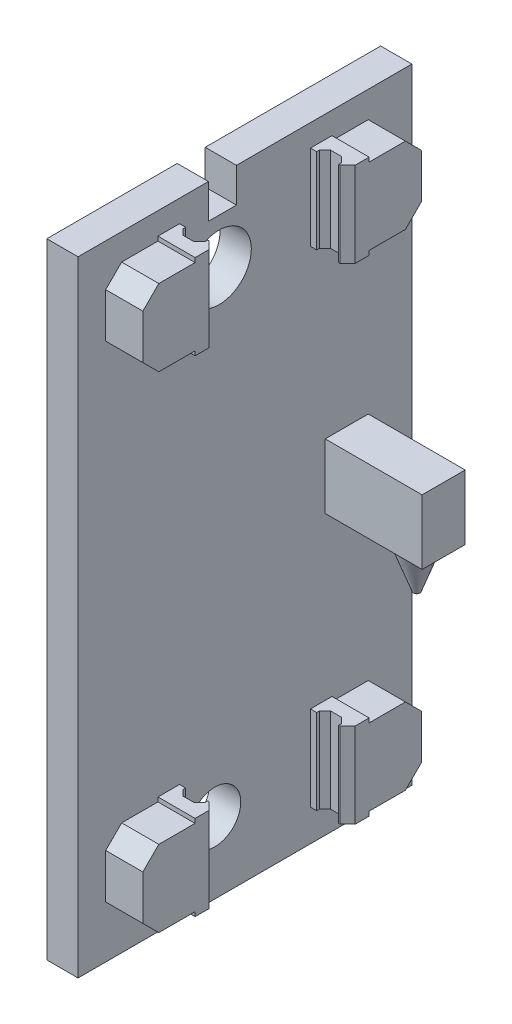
ISO-10303-21;
HEADER;
FILE_DESCRIPTION(('STEP AP214'),'2;1');
FILE_NAME('part.step','',(''),(''),'','','');
FILE_SCHEMA(('AUTOMOTIVE_DESIGN { 1 0 10303 214 1 1 1 1 }'));
ENDSEC;
DATA;
#1=APPLICATION_CONTEXT('core data for automotive mechanical design processes');
#2=APPLICATION_PROTOCOL_DEFINITION('international standard','automotive_design',2000,#1);
#3=PRODUCT_CONTEXT('',#1,'mechanical');
#4=PRODUCT('Part','Part','',(#3));
#5=PRODUCT_RELATED_PRODUCT_CATEGORY('part','',(#4));
#6=PRODUCT_DEFINITION_FORMATION('','',#4);
#7=PRODUCT_DEFINITION_CONTEXT('part definition',#1,'design');
#8=PRODUCT_DEFINITION('design','',#6,#7);
#9=PRODUCT_DEFINITION_SHAPE('','',#8);
#10=(LENGTH_UNIT() NAMED_UNIT(*) SI_UNIT(.MILLI.,.METRE.));
#11=(NAMED_UNIT(*) PLANE_ANGLE_UNIT() SI_UNIT($,.RADIAN.));
#12=(NAMED_UNIT(*) SI_UNIT($,.STERADIAN.) SOLID_ANGLE_UNIT());
#13=UNCERTAINTY_MEASURE_WITH_UNIT(LENGTH_MEASURE(1.E-05),#10,'distance_accuracy_value','');
#14=(GEOMETRIC_REPRESENTATION_CONTEXT(3) GLOBAL_UNCERTAINTY_ASSIGNED_CONTEXT((#13)) GLOBAL_UNIT_ASSIGNED_CONTEXT((#10,
#11,#12)) REPRESENTATION_CONTEXT('',''));
#15=CARTESIAN_POINT('',(0.,0.,0.));
#16=DIRECTION('',(0.,0.,1.));
#17=DIRECTION('',(1.,0.,0.));
#18=AXIS2_PLACEMENT_3D('',#15,#16,#17);
#19=CARTESIAN_POINT('',(254.35,-31.1999999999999,-94.5000000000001));
#20=DIRECTION('',(0.,1.,0.));
#21=DIRECTION('',(0.,0.,-1.));
#22=AXIS2_PLACEMENT_3D('',#19,#20,#21);
#23=CONICAL_SURFACE('',#22,17.5,0.349065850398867);
#24=CARTESIAN_POINT('',(254.35,-71.1999999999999,-94.5000000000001));
#25=DIRECTION('',(0.,-1.,0.));
#26=DIRECTION('',(0.,0.,-1.));
#27=AXIS2_PLACEMENT_3D('',#24,#25,#26);
#28=CIRCLE('',#27,2.94119062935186);
#29=CARTESIAN_POINT('',(254.35,-71.1999999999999,-97.4411906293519));
#30=VERTEX_POINT('',#29);
#31=EDGE_CURVE('E12',#30,#30,#28,.T.);
#32=CARTESIAN_POINT('',(254.35,-31.1999999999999,-94.5000000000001));
#33=DIRECTION('',(0.,-1.,0.));
#34=DIRECTION('',(0.,0.,-1.));
#35=AXIS2_PLACEMENT_3D('',#32,#33,#34);
#36=CIRCLE('',#35,17.5);
#37=CARTESIAN_POINT('',(254.35,-31.1999999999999,-112.));
#38=VERTEX_POINT('',#37);
#39=EDGE_CURVE('E59',#38,#38,#36,.T.);
#40=CARTESIAN_POINT('',(254.35,-71.1999999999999,-97.4411906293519));
#41=CARTESIAN_POINT('',(254.35,-70.7833333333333,-97.5928448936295));
#42=CARTESIAN_POINT('',(254.35,-70.3666666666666,-97.7444991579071));
#43=CARTESIAN_POINT('',(254.35,-69.5333333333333,-98.0478076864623));
#44=CARTESIAN_POINT('',(254.35,-69.1166666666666,-98.1994619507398));
#45=CARTESIAN_POINT('',(254.35,-68.2833333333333,-98.502770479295));
#46=CARTESIAN_POINT('',(254.35,-67.8666666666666,-98.6544247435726));
#47=CARTESIAN_POINT('',(254.35,-67.0333333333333,-98.9577332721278));
#48=CARTESIAN_POINT('',(254.35,-66.6166666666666,-99.1093875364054));
#49=CARTESIAN_POINT('',(254.35,-65.7833333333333,-99.4126960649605));
#50=CARTESIAN_POINT('',(254.35,-65.3666666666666,-99.5643503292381));
#51=CARTESIAN_POINT('',(254.35,-64.5333333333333,-99.8676588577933));
#52=CARTESIAN_POINT('',(254.35,-64.1166666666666,-100.019313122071));
#53=CARTESIAN_POINT('',(254.35,-63.2833333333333,-100.322621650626));
#54=CARTESIAN_POINT('',(254.35,-62.8666666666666,-100.474275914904));
#55=CARTESIAN_POINT('',(254.35,-62.0333333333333,-100.777584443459));
#56=CARTESIAN_POINT('',(254.35,-61.6166666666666,-100.929238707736));
#57=CARTESIAN_POINT('',(254.35,-60.7833333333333,-101.232547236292));
#58=CARTESIAN_POINT('',(254.35,-60.3666666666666,-101.384201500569));
#59=CARTESIAN_POINT('',(254.35,-59.5333333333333,-101.687510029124));
#60=CARTESIAN_POINT('',(254.35,-59.1166666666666,-101.839164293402));
#61=CARTESIAN_POINT('',(254.35,-58.2833333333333,-102.142472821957));
#62=CARTESIAN_POINT('',(254.35,-57.8666666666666,-102.294127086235));
#63=CARTESIAN_POINT('',(254.35,-57.0333333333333,-102.59743561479));
#64=CARTESIAN_POINT('',(254.35,-56.6166666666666,-102.749089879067));
#65=CARTESIAN_POINT('',(254.35,-55.7833333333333,-103.052398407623));
#66=CARTESIAN_POINT('',(254.35,-55.3666666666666,-103.2040526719));
#67=CARTESIAN_POINT('',(254.35,-54.5333333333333,-103.507361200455));
#68=CARTESIAN_POINT('',(254.35,-54.1166666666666,-103.659015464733));
#69=CARTESIAN_POINT('',(254.35,-53.2833333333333,-103.962323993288));
#70=CARTESIAN_POINT('',(254.35,-52.8666666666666,-104.113978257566));
#71=CARTESIAN_POINT('',(254.35,-52.0333333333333,-104.417286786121));
#72=CARTESIAN_POINT('',(254.35,-51.6166666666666,-104.568941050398));
#73=CARTESIAN_POINT('',(254.35,-50.7833333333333,-104.872249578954));
#74=CARTESIAN_POINT('',(254.35,-50.3666666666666,-105.023903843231));
#75=CARTESIAN_POINT('',(254.35,-49.5333333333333,-105.327212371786));
#76=CARTESIAN_POINT('',(254.35,-49.1166666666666,-105.478866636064));
#77=CARTESIAN_POINT('',(254.35,-48.2833333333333,-105.782175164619));
#78=CARTESIAN_POINT('',(254.35,-47.8666666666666,-105.933829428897));
#79=CARTESIAN_POINT('',(254.35,-47.0333333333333,-106.237137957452));
#80=CARTESIAN_POINT('',(254.35,-46.6166666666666,-106.388792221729));
#81=CARTESIAN_POINT('',(254.35,-45.7833333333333,-106.692100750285));
#82=CARTESIAN_POINT('',(254.35,-45.3666666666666,-106.843755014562));
#83=CARTESIAN_POINT('',(254.35,-44.5333333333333,-107.147063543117));
#84=CARTESIAN_POINT('',(254.35,-44.1166666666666,-107.298717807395));
#85=CARTESIAN_POINT('',(254.35,-43.2833333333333,-107.60202633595));
#86=CARTESIAN_POINT('',(254.35,-42.8666666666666,-107.753680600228));
#87=CARTESIAN_POINT('',(254.35,-42.0333333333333,-108.056989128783));
#88=CARTESIAN_POINT('',(254.35,-41.6166666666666,-108.20864339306));
#89=CARTESIAN_POINT('',(254.35,-40.7833333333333,-108.511951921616));
#90=CARTESIAN_POINT('',(254.35,-40.3666666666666,-108.663606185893));
#91=CARTESIAN_POINT('',(254.35,-39.5333333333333,-108.966914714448));
#92=CARTESIAN_POINT('',(254.35,-39.1166666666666,-109.118568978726));
#93=CARTESIAN_POINT('',(254.35,-38.2833333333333,-109.421877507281));
#94=CARTESIAN_POINT('',(254.35,-37.8666666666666,-109.573531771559));
#95=CARTESIAN_POINT('',(254.35,-37.0333333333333,-109.876840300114));
#96=CARTESIAN_POINT('',(254.35,-36.6166666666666,-110.028494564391));
#97=CARTESIAN_POINT('',(254.35,-35.7833333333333,-110.331803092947));
#98=CARTESIAN_POINT('',(254.35,-35.3666666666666,-110.483457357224));
#99=CARTESIAN_POINT('',(254.35,-34.5333333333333,-110.786765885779));
#100=CARTESIAN_POINT('',(254.35,-34.1166666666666,-110.938420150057));
#101=CARTESIAN_POINT('',(254.35,-33.2833333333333,-111.241728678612));
#102=CARTESIAN_POINT('',(254.35,-32.8666666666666,-111.39338294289));
#103=CARTESIAN_POINT('',(254.35,-32.0333333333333,-111.696691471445));
#104=CARTESIAN_POINT('',(254.35,-31.6166666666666,-111.848345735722));
#105=CARTESIAN_POINT('',(254.35,-31.1999999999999,-112.));
#106=B_SPLINE_CURVE_WITH_KNOTS('',3,(#40,#41,#42,#43,#44,#45,#46,#47,#48,#49,#50,#51,#52,#53,
#54,#55,#56,#57,#58,#59,#60,#61,#62,#63,#64,#65,#66,#67,#68,#69,#70,#71,#72,#73,#74,#75,#76,#77,
#78,#79,#80,#81,#82,#83,#84,#85,#86,#87,#88,#89,#90,#91,#92,#93,#94,#95,#96,#97,#98,#99,#100,
#101,#102,#103,#104,#105),.UNSPECIFIED.,.F.,.F.,(4,2,2,2,2,2,2,2,2,2,2,2,2,2,2,2,2,2,2,2,2,2,2,
2,2,2,2,2,2,2,2,2,4),(0.,1.33022221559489,2.66044443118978,3.99066664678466,5.32088886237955,
6.65111107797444,7.98133329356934,9.31155550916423,10.6417777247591,11.971999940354,
13.3022221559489,14.6324443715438,15.9626665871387,17.2928888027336,18.6231110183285,
19.9533332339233,21.2835554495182,22.6137776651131,23.943999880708,25.2742220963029,
26.6044443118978,27.9346665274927,29.2648887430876,30.5951109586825,31.9253331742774,
33.2555553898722,34.5857776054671,35.915999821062,37.2462220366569,38.5764442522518,
39.9066664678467,41.2368886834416,42.5671108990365),.UNSPECIFIED.);
#107=EDGE_CURVE('BSEAM53',#30,#38,#106,.T.);
#108=ORIENTED_EDGE('',*,*,#31,.F.);
#109=ORIENTED_EDGE('',*,*,#39,.T.);
#110=ORIENTED_EDGE('',*,*,#107,.T.);
#111=ORIENTED_EDGE('',*,*,#107,.F.);
#112=EDGE_LOOP('',(#108,#110,#109,#111));
#113=FACE_BOUND('',#112,.T.);
#114=ADVANCED_FACE('F53',(#113),#23,.T.);
#115=CARTESIAN_POINT('',(254.35,-71.1999999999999,-94.5000000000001));
#116=DIRECTION('',(0.,-1.,0.));
#117=DIRECTION('',(0.,0.,-1.));
#118=AXIS2_PLACEMENT_3D('',#115,#116,#117);
#119=PLANE('',#118);
#120=ORIENTED_EDGE('',*,*,#31,.T.);
#121=EDGE_LOOP('',(#120));
#122=FACE_BOUND('',#121,.T.);
#123=ADVANCED_FACE('F68',(#122),#119,.T.);
#124=CARTESIAN_POINT('',(254.35,-31.1999999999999,-94.5000000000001));
#125=DIRECTION('',(0.,-1.,0.));
#126=DIRECTION('',(0.,0.,-1.));
#127=AXIS2_PLACEMENT_3D('',#124,#125,#126);
#128=PLANE('',#127);
#129=ORIENTED_EDGE('',*,*,#39,.F.);
#130=EDGE_LOOP('',(#129));
#131=FACE_BOUND('',#130,.T.);
#132=ADVANCED_FACE('F66',(#131),#128,.F.);
#133=CLOSED_SHELL('',(#114,#123,#132));
#134=MANIFOLD_SOLID_BREP('B2',#133);
#135=CARTESIAN_POINT('',(189.35,-290.,155.));
#136=DIRECTION('',(1.,0.,0.));
#137=DIRECTION('',(0.,0.,-1.));
#138=AXIS2_PLACEMENT_3D('',#135,#136,#137);
#139=PLANE('',#138);
#140=CARTESIAN_POINT('',(189.35,-224.,27.9099999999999));
#141=DIRECTION('',(1.,0.,0.));
#142=DIRECTION('',(0.,0.,-1.));
#143=AXIS2_PLACEMENT_3D('',#140,#141,#142);
#144=CIRCLE('',#143,24.);
#145=CARTESIAN_POINT('',(189.35,-224.,3.90999999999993));
#146=VERTEX_POINT('',#145);
#147=EDGE_CURVE('E1197',#146,#146,#144,.T.);
#148=ORIENTED_EDGE('',*,*,#147,.F.);
#149=EDGE_LOOP('',(#148));
#150=FACE_BOUND('',#149,.T.);
#151=CARTESIAN_POINT('',(189.35,216.,24.09));
#152=DIRECTION('',(1.,0.,0.));
#153=DIRECTION('',(0.,0.,-1.));
#154=AXIS2_PLACEMENT_3D('',#151,#152,#153);
#155=CIRCLE('',#154,30.);
#156=CARTESIAN_POINT('',(189.35,216.,-5.91000000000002));
#157=VERTEX_POINT('',#156);
#158=EDGE_CURVE('E1202',#157,#157,#155,.T.);
#159=ORIENTED_EDGE('',*,*,#158,.F.);
#160=EDGE_LOOP('',(#159));
#161=FACE_BOUND('',#160,.T.);
#162=DIRECTION('',(0.,-1.,0.));
#163=VECTOR('',#162,1.);
#164=CARTESIAN_POINT('',(189.35,290.,155.));
#165=LINE('',#164,#163);
#166=CARTESIAN_POINT('',(189.35,290.,155.));
#167=VERTEX_POINT('',#166);
#168=CARTESIAN_POINT('',(189.35,-290.,155.));
#169=VERTEX_POINT('',#168);
#170=EDGE_CURVE('E1209',#167,#169,#165,.T.);
#171=ORIENTED_EDGE('',*,*,#170,.T.);
#172=DIRECTION('',(0.,0.,-1.));
#173=VECTOR('',#172,1.);
#174=CARTESIAN_POINT('',(189.35,-290.,155.));
#175=LINE('',#174,#173);
#176=CARTESIAN_POINT('',(189.35,-290.,-155.));
#177=VERTEX_POINT('',#176);
#178=EDGE_CURVE('E1243',#169,#177,#175,.T.);
#179=ORIENTED_EDGE('',*,*,#178,.T.);
#180=DIRECTION('',(0.,1.,0.));
#181=VECTOR('',#180,1.);
#182=CARTESIAN_POINT('',(189.35,-290.,-155.));
#183=LINE('',#182,#181);
#184=CARTESIAN_POINT('',(189.35,290.,-155.));
#185=VERTEX_POINT('',#184);
#186=EDGE_CURVE('E1247',#177,#185,#183,.T.);
#187=ORIENTED_EDGE('',*,*,#186,.T.);
#188=DIRECTION('',(0.,0.,1.));
#189=VECTOR('',#188,1.);
#190=CARTESIAN_POINT('',(189.35,290.,-155.));
#191=LINE('',#190,#189);
#192=CARTESIAN_POINT('',(189.35,290.,7.9));
#193=VERTEX_POINT('',#192);
#194=EDGE_CURVE('E1250',#185,#193,#191,.T.);
#195=ORIENTED_EDGE('',*,*,#194,.T.);
#196=DIRECTION('',(0.,-1.,0.));
#197=VECTOR('',#196,1.);
#198=CARTESIAN_POINT('',(189.35,290.,7.9));
#199=LINE('',#198,#197);
#200=CARTESIAN_POINT('',(189.35,258.,7.9));
#201=VERTEX_POINT('',#200);
#202=EDGE_CURVE('E1253',#193,#201,#199,.T.);
#203=ORIENTED_EDGE('',*,*,#202,.T.);
#204=DIRECTION('',(0.,0.,1.));
#205=VECTOR('',#204,1.);
#206=CARTESIAN_POINT('',(189.35,258.,33.9));
#207=LINE('',#206,#205);
#208=CARTESIAN_POINT('',(189.35,258.,33.9));
#209=VERTEX_POINT('',#208);
#210=EDGE_CURVE('E1256',#201,#209,#207,.T.);
#211=ORIENTED_EDGE('',*,*,#210,.T.);
#212=DIRECTION('',(0.,1.,0.));
#213=VECTOR('',#212,1.);
#214=CARTESIAN_POINT('',(189.35,290.,33.9));
#215=LINE('',#214,#213);
#216=CARTESIAN_POINT('',(189.35,290.,33.9));
#217=VERTEX_POINT('',#216);
#218=EDGE_CURVE('E1259',#209,#217,#215,.T.);
#219=ORIENTED_EDGE('',*,*,#218,.T.);
#220=DIRECTION('',(0.,0.,1.));
#221=VECTOR('',#220,1.);
#222=CARTESIAN_POINT('',(189.35,290.,33.9));
#223=LINE('',#222,#221);
#224=EDGE_CURVE('E1217',#217,#167,#223,.T.);
#225=ORIENTED_EDGE('',*,*,#224,.T.);
#226=EDGE_LOOP('',(#171,#179,#187,#195,#203,#211,#219,#225));
#227=FACE_BOUND('',#226,.T.);
#228=DIRECTION('',(0.,-1.,0.));
#229=VECTOR('',#228,1.);
#230=CARTESIAN_POINT('',(189.35,250.7,129.3));
#231=LINE('',#230,#229);
#232=CARTESIAN_POINT('',(189.35,250.7,129.3));
#233=VERTEX_POINT('',#232);
#234=CARTESIAN_POINT('',(189.35,209.3,129.3));
#235=VERTEX_POINT('',#234);
#236=EDGE_CURVE('E1150',#233,#235,#231,.T.);
#237=ORIENTED_EDGE('',*,*,#236,.F.);
#238=DIRECTION('',(0.,-0.707106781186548,0.707106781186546));
#239=VECTOR('',#238,1.);
#240=CARTESIAN_POINT('',(189.35,265.5,114.5));
#241=LINE('',#240,#239);
#242=CARTESIAN_POINT('',(189.35,265.5,114.5));
#243=VERTEX_POINT('',#242);
#244=EDGE_CURVE('E1125',#243,#233,#241,.T.);
#245=ORIENTED_EDGE('',*,*,#244,.F.);
#246=DIRECTION('',(0.,0.,1.));
#247=VECTOR('',#246,1.);
#248=CARTESIAN_POINT('',(189.35,265.5,80.8));
#249=LINE('',#248,#247);
#250=CARTESIAN_POINT('',(189.35,265.5,80.8));
#251=VERTEX_POINT('',#250);
#252=EDGE_CURVE('E1130',#251,#243,#249,.T.);
#253=ORIENTED_EDGE('',*,*,#252,.F.);
#254=DIRECTION('',(0.,-1.,0.));
#255=VECTOR('',#254,1.);
#256=CARTESIAN_POINT('',(189.35,265.5,80.8));
#257=LINE('',#256,#255);
#258=CARTESIAN_POINT('',(189.35,269.5,80.8));
#259=VERTEX_POINT('',#258);
#260=EDGE_CURVE('E1166',#259,#251,#257,.T.);
#261=ORIENTED_EDGE('',*,*,#260,.F.);
#262=DIRECTION('',(0.,0.,1.));
#263=VECTOR('',#262,1.);
#264=CARTESIAN_POINT('',(189.35,269.5,80.8));
#265=LINE('',#264,#263);
#266=CARTESIAN_POINT('',(189.35,269.5,60.8));
#267=VERTEX_POINT('',#266);
#268=EDGE_CURVE('E1164',#267,#259,#265,.T.);
#269=ORIENTED_EDGE('',*,*,#268,.F.);
#270=DIRECTION('',(0.,1.,0.));
#271=VECTOR('',#270,1.);
#272=CARTESIAN_POINT('',(189.35,269.5,60.8));
#273=LINE('',#272,#271);
#274=CARTESIAN_POINT('',(189.35,190.5,60.8));
#275=VERTEX_POINT('',#274);
#276=EDGE_CURVE('E1161',#275,#267,#273,.T.);
#277=ORIENTED_EDGE('',*,*,#276,.F.);
#278=DIRECTION('',(0.,0.,-1.));
#279=VECTOR('',#278,1.);
#280=CARTESIAN_POINT('',(189.35,190.5,60.8));
#281=LINE('',#280,#279);
#282=CARTESIAN_POINT('',(189.35,190.5,80.8));
#283=VERTEX_POINT('',#282);
#284=EDGE_CURVE('E1158',#283,#275,#281,.T.);
#285=ORIENTED_EDGE('',*,*,#284,.F.);
#286=DIRECTION('',(0.,-1.,0.));
#287=VECTOR('',#286,1.);
#288=CARTESIAN_POINT('',(189.35,190.5,80.8));
#289=LINE('',#288,#287);
#290=CARTESIAN_POINT('',(189.35,194.5,80.8));
#291=VERTEX_POINT('',#290);
#292=EDGE_CURVE('E1156',#291,#283,#289,.T.);
#293=ORIENTED_EDGE('',*,*,#292,.F.);
#294=DIRECTION('',(0.,0.,-1.));
#295=VECTOR('',#294,1.);
#296=CARTESIAN_POINT('',(189.35,194.5,80.8));
#297=LINE('',#296,#295);
#298=CARTESIAN_POINT('',(189.35,194.5,114.5));
#299=VERTEX_POINT('',#298);
#300=EDGE_CURVE('E1154',#299,#291,#297,.T.);
#301=ORIENTED_EDGE('',*,*,#300,.F.);
#302=DIRECTION('',(0.,-0.707106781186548,-0.707106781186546));
#303=VECTOR('',#302,1.);
#304=CARTESIAN_POINT('',(189.35,194.5,114.5));
#305=LINE('',#304,#303);
#306=EDGE_CURVE('E1152',#235,#299,#305,.T.);
#307=ORIENTED_EDGE('',*,*,#306,.F.);
#308=EDGE_LOOP('',(#237,#245,#253,#261,#269,#277,#285,#293,#301,#307));
#309=FACE_BOUND('',#308,.T.);
#310=DIRECTION('',(0.,0.,1.));
#311=VECTOR('',#310,1.);
#312=CARTESIAN_POINT('',(189.35,265.5,-80.8));
#313=LINE('',#312,#311);
#314=CARTESIAN_POINT('',(189.35,265.5,-114.5));
#315=VERTEX_POINT('',#314);
#316=CARTESIAN_POINT('',(189.35,265.5,-80.8));
#317=VERTEX_POINT('',#316);
#318=EDGE_CURVE('E1078',#315,#317,#313,.T.);
#319=ORIENTED_EDGE('',*,*,#318,.F.);
#320=DIRECTION('',(0.,0.70710678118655,0.707106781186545));
#321=VECTOR('',#320,1.);
#322=CARTESIAN_POINT('',(189.35,265.5,-114.5));
#323=LINE('',#322,#321);
#324=CARTESIAN_POINT('',(189.35,250.7,-129.3));
#325=VERTEX_POINT('',#324);
#326=EDGE_CURVE('E1053',#325,#315,#323,.T.);
#327=ORIENTED_EDGE('',*,*,#326,.F.);
#328=DIRECTION('',(0.,1.,0.));
#329=VECTOR('',#328,1.);
#330=CARTESIAN_POINT('',(189.35,250.7,-129.3));
#331=LINE('',#330,#329);
#332=CARTESIAN_POINT('',(189.35,209.3,-129.3));
#333=VERTEX_POINT('',#332);
#334=EDGE_CURVE('E1058',#333,#325,#331,.T.);
#335=ORIENTED_EDGE('',*,*,#334,.F.);
#336=DIRECTION('',(0.,0.70710678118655,-0.707106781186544));
#337=VECTOR('',#336,1.);
#338=CARTESIAN_POINT('',(189.35,194.5,-114.5));
#339=LINE('',#338,#337);
#340=CARTESIAN_POINT('',(189.35,194.5,-114.5));
#341=VERTEX_POINT('',#340);
#342=EDGE_CURVE('E1094',#341,#333,#339,.T.);
#343=ORIENTED_EDGE('',*,*,#342,.F.);
#344=DIRECTION('',(0.,0.,-1.));
#345=VECTOR('',#344,1.);
#346=CARTESIAN_POINT('',(189.35,194.5,-80.8));
#347=LINE('',#346,#345);
#348=CARTESIAN_POINT('',(189.35,194.5,-80.8));
#349=VERTEX_POINT('',#348);
#350=EDGE_CURVE('E1092',#349,#341,#347,.T.);
#351=ORIENTED_EDGE('',*,*,#350,.F.);
#352=DIRECTION('',(0.,1.,0.));
#353=VECTOR('',#352,1.);
#354=CARTESIAN_POINT('',(189.35,190.5,-80.8));
#355=LINE('',#354,#353);
#356=CARTESIAN_POINT('',(189.35,190.5,-80.8));
#357=VERTEX_POINT('',#356);
#358=EDGE_CURVE('E1090',#357,#349,#355,.T.);
#359=ORIENTED_EDGE('',*,*,#358,.F.);
#360=DIRECTION('',(0.,0.,-1.));
#361=VECTOR('',#360,1.);
#362=CARTESIAN_POINT('',(189.35,190.5,-60.7999999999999));
#363=LINE('',#362,#361);
#364=CARTESIAN_POINT('',(189.35,190.5,-60.7999999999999));
#365=VERTEX_POINT('',#364);
#366=EDGE_CURVE('E1088',#365,#357,#363,.T.);
#367=ORIENTED_EDGE('',*,*,#366,.F.);
#368=DIRECTION('',(0.,-1.,0.));
#369=VECTOR('',#368,1.);
#370=CARTESIAN_POINT('',(189.35,269.5,-60.8));
#371=LINE('',#370,#369);
#372=CARTESIAN_POINT('',(189.35,269.5,-60.8));
#373=VERTEX_POINT('',#372);
#374=EDGE_CURVE('E1085',#373,#365,#371,.T.);
#375=ORIENTED_EDGE('',*,*,#374,.F.);
#376=DIRECTION('',(0.,0.,1.));
#377=VECTOR('',#376,1.);
#378=CARTESIAN_POINT('',(189.35,269.5,-60.8));
#379=LINE('',#378,#377);
#380=CARTESIAN_POINT('',(189.35,269.5,-80.8));
#381=VERTEX_POINT('',#380);
#382=EDGE_CURVE('E1082',#381,#373,#379,.T.);
#383=ORIENTED_EDGE('',*,*,#382,.F.);
#384=DIRECTION('',(0.,1.,0.));
#385=VECTOR('',#384,1.);
#386=CARTESIAN_POINT('',(189.35,269.5,-80.8));
#387=LINE('',#386,#385);
#388=EDGE_CURVE('E1080',#317,#381,#387,.T.);
#389=ORIENTED_EDGE('',*,*,#388,.F.);
#390=EDGE_LOOP('',(#319,#327,#335,#343,#351,#359,#367,#375,#383,#389));
#391=FACE_BOUND('',#390,.T.);
#392=DIRECTION('',(0.,-1.,0.));
#393=VECTOR('',#392,1.);
#394=CARTESIAN_POINT('',(189.35,-200.3,129.3));
#395=LINE('',#394,#393);
#396=CARTESIAN_POINT('',(189.35,-200.3,129.3));
#397=VERTEX_POINT('',#396);
#398=CARTESIAN_POINT('',(189.35,-241.7,129.3));
#399=VERTEX_POINT('',#398);
#400=EDGE_CURVE('E987',#397,#399,#395,.T.);
#401=ORIENTED_EDGE('',*,*,#400,.F.);
#402=DIRECTION('',(0.,-0.707106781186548,0.707106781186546));
#403=VECTOR('',#402,1.);
#404=CARTESIAN_POINT('',(189.35,-185.5,114.5));
#405=LINE('',#404,#403);
#406=CARTESIAN_POINT('',(189.35,-185.5,114.5));
#407=VERTEX_POINT('',#406);
#408=EDGE_CURVE('E952',#407,#397,#405,.T.);
#409=ORIENTED_EDGE('',*,*,#408,.F.);
#410=DIRECTION('',(0.,0.,1.));
#411=VECTOR('',#410,1.);
#412=CARTESIAN_POINT('',(189.35,-185.5,80.7999999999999));
#413=LINE('',#412,#411);
#414=CARTESIAN_POINT('',(189.35,-185.5,80.7999999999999));
#415=VERTEX_POINT('',#414);
#416=EDGE_CURVE('E958',#415,#407,#413,.T.);
#417=ORIENTED_EDGE('',*,*,#416,.F.);
#418=DIRECTION('',(0.,-1.,0.));
#419=VECTOR('',#418,1.);
#420=CARTESIAN_POINT('',(189.35,-185.5,80.7999999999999));
#421=LINE('',#420,#419);
#422=CARTESIAN_POINT('',(189.35,-181.5,80.8));
#423=VERTEX_POINT('',#422);
#424=EDGE_CURVE('E1010',#423,#415,#421,.T.);
#425=ORIENTED_EDGE('',*,*,#424,.F.);
#426=DIRECTION('',(0.,0.,1.));
#427=VECTOR('',#426,1.);
#428=CARTESIAN_POINT('',(189.35,-181.5,80.8));
#429=LINE('',#428,#427);
#430=CARTESIAN_POINT('',(189.35,-181.5,60.7999999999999));
#431=VERTEX_POINT('',#430);
#432=EDGE_CURVE('E1007',#431,#423,#429,.T.);
#433=ORIENTED_EDGE('',*,*,#432,.F.);
#434=DIRECTION('',(0.,1.,0.));
#435=VECTOR('',#434,1.);
#436=CARTESIAN_POINT('',(189.35,-181.5,60.7999999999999));
#437=LINE('',#436,#435);
#438=CARTESIAN_POINT('',(189.35,-260.5,60.7999999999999));
#439=VERTEX_POINT('',#438);
#440=EDGE_CURVE('E1003',#439,#431,#437,.T.);
#441=ORIENTED_EDGE('',*,*,#440,.F.);
#442=DIRECTION('',(0.,0.,-1.));
#443=VECTOR('',#442,1.);
#444=CARTESIAN_POINT('',(189.35,-260.5,60.7999999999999));
#445=LINE('',#444,#443);
#446=CARTESIAN_POINT('',(189.35,-260.5,80.8));
#447=VERTEX_POINT('',#446);
#448=EDGE_CURVE('E999',#447,#439,#445,.T.);
#449=ORIENTED_EDGE('',*,*,#448,.F.);
#450=DIRECTION('',(0.,-1.,0.));
#451=VECTOR('',#450,1.);
#452=CARTESIAN_POINT('',(189.35,-260.5,80.8));
#453=LINE('',#452,#451);
#454=CARTESIAN_POINT('',(189.35,-256.5,80.7999999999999));
#455=VERTEX_POINT('',#454);
#456=EDGE_CURVE('E996',#455,#447,#453,.T.);
#457=ORIENTED_EDGE('',*,*,#456,.F.);
#458=DIRECTION('',(0.,0.,-1.));
#459=VECTOR('',#458,1.);
#460=CARTESIAN_POINT('',(189.35,-256.5,80.7999999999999));
#461=LINE('',#460,#459);
#462=CARTESIAN_POINT('',(189.35,-256.5,114.5));
#463=VERTEX_POINT('',#462);
#464=EDGE_CURVE('E993',#463,#455,#461,.T.);
#465=ORIENTED_EDGE('',*,*,#464,.F.);
#466=DIRECTION('',(0.,-0.707106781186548,-0.707106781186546));
#467=VECTOR('',#466,1.);
#468=CARTESIAN_POINT('',(189.35,-256.5,114.5));
#469=LINE('',#468,#467);
#470=EDGE_CURVE('E990',#399,#463,#469,.T.);
#471=ORIENTED_EDGE('',*,*,#470,.F.);
#472=EDGE_LOOP('',(#401,#409,#417,#425,#433,#441,#449,#457,#465,#471));
#473=FACE_BOUND('',#472,.T.);
#474=DIRECTION('',(0.,0.,1.));
#475=VECTOR('',#474,1.);
#476=CARTESIAN_POINT('',(189.35,-185.5,-80.8000000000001));
#477=LINE('',#476,#475);
#478=CARTESIAN_POINT('',(189.35,-185.5,-114.5));
#479=VERTEX_POINT('',#478);
#480=CARTESIAN_POINT('',(189.35,-185.5,-80.8000000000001));
#481=VERTEX_POINT('',#480);
#482=EDGE_CURVE('E898',#479,#481,#477,.T.);
#483=ORIENTED_EDGE('',*,*,#482,.F.);
#484=DIRECTION('',(0.,0.70710678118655,0.707106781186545));
#485=VECTOR('',#484,1.);
#486=CARTESIAN_POINT('',(189.35,-185.5,-114.5));
#487=LINE('',#486,#485);
#488=CARTESIAN_POINT('',(189.35,-200.3,-129.3));
#489=VERTEX_POINT('',#488);
#490=EDGE_CURVE('E870',#489,#479,#487,.T.);
#491=ORIENTED_EDGE('',*,*,#490,.F.);
#492=DIRECTION('',(0.,1.,0.));
#493=VECTOR('',#492,1.);
#494=CARTESIAN_POINT('',(189.35,-200.3,-129.3));
#495=LINE('',#494,#493);
#496=CARTESIAN_POINT('',(189.35,-241.7,-129.3));
#497=VERTEX_POINT('',#496);
#498=EDGE_CURVE('E875',#497,#489,#495,.T.);
#499=ORIENTED_EDGE('',*,*,#498,.F.);
#500=DIRECTION('',(0.,0.70710678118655,-0.707106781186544));
#501=VECTOR('',#500,1.);
#502=CARTESIAN_POINT('',(189.35,-256.5,-114.5));
#503=LINE('',#502,#501);
#504=CARTESIAN_POINT('',(189.35,-256.5,-114.5));
#505=VERTEX_POINT('',#504);
#506=EDGE_CURVE('E918',#505,#497,#503,.T.);
#507=ORIENTED_EDGE('',*,*,#506,.F.);
#508=DIRECTION('',(0.,0.,-1.));
#509=VECTOR('',#508,1.);
#510=CARTESIAN_POINT('',(189.35,-256.5,-80.8000000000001));
#511=LINE('',#510,#509);
#512=CARTESIAN_POINT('',(189.35,-256.5,-80.8000000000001));
#513=VERTEX_POINT('',#512);
#514=EDGE_CURVE('E916',#513,#505,#511,.T.);
#515=ORIENTED_EDGE('',*,*,#514,.F.);
#516=DIRECTION('',(0.,1.,0.));
#517=VECTOR('',#516,1.);
#518=CARTESIAN_POINT('',(189.35,-260.5,-80.8000000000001));
#519=LINE('',#518,#517);
#520=CARTESIAN_POINT('',(189.35,-260.5,-80.8000000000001));
#521=VERTEX_POINT('',#520);
#522=EDGE_CURVE('E914',#521,#513,#519,.T.);
#523=ORIENTED_EDGE('',*,*,#522,.F.);
#524=DIRECTION('',(0.,0.,-1.));
#525=VECTOR('',#524,1.);
#526=CARTESIAN_POINT('',(189.35,-260.5,-60.8));
#527=LINE('',#526,#525);
#528=CARTESIAN_POINT('',(189.35,-260.5,-60.8));
#529=VERTEX_POINT('',#528);
#530=EDGE_CURVE('E912',#529,#521,#527,.T.);
#531=ORIENTED_EDGE('',*,*,#530,.F.);
#532=DIRECTION('',(0.,-1.,0.));
#533=VECTOR('',#532,1.);
#534=CARTESIAN_POINT('',(189.35,-181.5,-60.8));
#535=LINE('',#534,#533);
#536=CARTESIAN_POINT('',(189.35,-181.5,-60.8));
#537=VERTEX_POINT('',#536);
#538=EDGE_CURVE('E908',#537,#529,#535,.T.);
#539=ORIENTED_EDGE('',*,*,#538,.F.);
#540=DIRECTION('',(0.,0.,1.));
#541=VECTOR('',#540,1.);
#542=CARTESIAN_POINT('',(189.35,-181.5,-60.8));
#543=LINE('',#542,#541);
#544=CARTESIAN_POINT('',(189.35,-181.5,-80.8000000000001));
#545=VERTEX_POINT('',#544);
#546=EDGE_CURVE('E904',#545,#537,#543,.T.);
#547=ORIENTED_EDGE('',*,*,#546,.F.);
#548=DIRECTION('',(0.,1.,0.));
#549=VECTOR('',#548,1.);
#550=CARTESIAN_POINT('',(189.35,-181.5,-80.8000000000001));
#551=LINE('',#550,#549);
#552=EDGE_CURVE('E901',#481,#545,#551,.T.);
#553=ORIENTED_EDGE('',*,*,#552,.F.);
#554=EDGE_LOOP('',(#483,#491,#499,#507,#515,#523,#531,#539,#547,#553));
#555=FACE_BOUND('',#554,.T.);
#556=DIRECTION('',(0.,0.,-1.));
#557=VECTOR('',#556,1.);
#558=CARTESIAN_POINT('',(189.35,-31.1999999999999,-74.5000000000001));
#559=LINE('',#558,#557);
#560=CARTESIAN_POINT('',(189.35,-31.1999999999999,-74.5000000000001));
#561=VERTEX_POINT('',#560);
#562=CARTESIAN_POINT('',(189.35,-31.1999999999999,-114.5));
#563=VERTEX_POINT('',#562);
#564=EDGE_CURVE('E1339',#561,#563,#559,.T.);
#565=ORIENTED_EDGE('',*,*,#564,.F.);
#566=DIRECTION('',(0.,-1.,0.));
#567=VECTOR('',#566,1.);
#568=CARTESIAN_POINT('',(189.35,28.8,-74.5000000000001));
#569=LINE('',#568,#567);
#570=CARTESIAN_POINT('',(189.35,28.8,-74.5000000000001));
#571=VERTEX_POINT('',#570);
#572=EDGE_CURVE('E672',#571,#561,#569,.T.);
#573=ORIENTED_EDGE('',*,*,#572,.F.);
#574=DIRECTION('',(0.,0.,1.));
#575=VECTOR('',#574,1.);
#576=CARTESIAN_POINT('',(189.35,28.8,-74.5000000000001));
#577=LINE('',#576,#575);
#578=CARTESIAN_POINT('',(189.35,28.8,-114.5));
#579=VERTEX_POINT('',#578);
#580=EDGE_CURVE('E668',#579,#571,#577,.T.);
#581=ORIENTED_EDGE('',*,*,#580,.F.);
#582=DIRECTION('',(0.,1.,0.));
#583=VECTOR('',#582,1.);
#584=CARTESIAN_POINT('',(189.35,28.8,-114.5));
#585=LINE('',#584,#583);
#586=EDGE_CURVE('E1342',#563,#579,#585,.T.);
#587=ORIENTED_EDGE('',*,*,#586,.F.);
#588=EDGE_LOOP('',(#565,#573,#581,#587));
#589=FACE_BOUND('',#588,.T.);
#590=ADVANCED_FACE('F93',(#150,#161,#227,#309,#391,#473,#555,#589),#139,.T.);
#591=CARTESIAN_POINT('',(223.85,269.5,60.8));
#592=DIRECTION('',(0.,0.,1.));
#593=DIRECTION('',(1.,0.,0.));
#594=AXIS2_PLACEMENT_3D('',#591,#592,#593);
#595=PLANE('',#594);
#596=DIRECTION('',(-1.,0.,0.));
#597=VECTOR('',#596,1.);
#598=CARTESIAN_POINT('',(223.85,269.5,60.8));
#599=LINE('',#598,#597);
#600=CARTESIAN_POINT('',(195.1,269.5,60.8));
#601=VERTEX_POINT('',#600);
#602=EDGE_CURVE('E1177',#601,#267,#599,.T.);
#603=ORIENTED_EDGE('',*,*,#602,.F.);
#604=DIRECTION('',(0.,-1.,0.));
#605=VECTOR('',#604,1.);
#606=CARTESIAN_POINT('',(195.1,269.5,60.8));
#607=LINE('',#606,#605);
#608=CARTESIAN_POINT('',(195.1,190.5,60.8));
#609=VERTEX_POINT('',#608);
#610=EDGE_CURVE('E759',#601,#609,#607,.T.);
#611=ORIENTED_EDGE('',*,*,#610,.T.);
#612=DIRECTION('',(-1.,0.,0.));
#613=VECTOR('',#612,1.);
#614=CARTESIAN_POINT('',(223.85,190.5,60.8));
#615=LINE('',#614,#613);
#616=EDGE_CURVE('E1180',#609,#275,#615,.T.);
#617=ORIENTED_EDGE('',*,*,#616,.T.);
#618=ORIENTED_EDGE('',*,*,#276,.T.);
#619=EDGE_LOOP('',(#603,#611,#617,#618));
#620=FACE_BOUND('',#619,.T.);
#621=ADVANCED_FACE('F1361',(#620),#595,.F.);
#622=CARTESIAN_POINT('',(223.85,-181.5,60.7999999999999));
#623=DIRECTION('',(0.,0.,1.));
#624=DIRECTION('',(1.,0.,0.));
#625=AXIS2_PLACEMENT_3D('',#622,#623,#624);
#626=PLANE('',#625);
#627=DIRECTION('',(-1.,0.,0.));
#628=VECTOR('',#627,1.);
#629=CARTESIAN_POINT('',(223.85,-181.5,60.7999999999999));
#630=LINE('',#629,#628);
#631=CARTESIAN_POINT('',(195.1,-181.5,60.7999999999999));
#632=VERTEX_POINT('',#631);
#633=EDGE_CURVE('E1026',#632,#431,#630,.T.);
#634=ORIENTED_EDGE('',*,*,#633,.F.);
#635=DIRECTION('',(0.,-1.,0.));
#636=VECTOR('',#635,1.);
#637=CARTESIAN_POINT('',(195.1,-181.5,60.7999999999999));
#638=LINE('',#637,#636);
#639=CARTESIAN_POINT('',(195.1,-260.5,60.7999999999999));
#640=VERTEX_POINT('',#639);
#641=EDGE_CURVE('E748',#632,#640,#638,.T.);
#642=ORIENTED_EDGE('',*,*,#641,.T.);
#643=DIRECTION('',(-1.,0.,0.));
#644=VECTOR('',#643,1.);
#645=CARTESIAN_POINT('',(223.85,-260.5,60.7999999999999));
#646=LINE('',#645,#644);
#647=EDGE_CURVE('E1030',#640,#439,#646,.T.);
#648=ORIENTED_EDGE('',*,*,#647,.T.);
#649=ORIENTED_EDGE('',*,*,#440,.T.);
#650=EDGE_LOOP('',(#634,#642,#648,#649));
#651=FACE_BOUND('',#650,.T.);
#652=ADVANCED_FACE('F1367',(#651),#626,.F.);
#653=CARTESIAN_POINT('',(223.85,269.5,-60.8));
#654=DIRECTION('',(0.,0.,-1.));
#655=DIRECTION('',(0.,1.,0.));
#656=AXIS2_PLACEMENT_3D('',#653,#654,#655);
#657=PLANE('',#656);
#658=DIRECTION('',(-1.,0.,0.));
#659=VECTOR('',#658,1.);
#660=CARTESIAN_POINT('',(223.85,269.5,-60.8));
#661=LINE('',#660,#659);
#662=CARTESIAN_POINT('',(216.85,269.5,-60.7999999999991));
#663=VERTEX_POINT('',#662);
#664=CARTESIAN_POINT('',(215.6,269.5,-60.7999999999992));
#665=VERTEX_POINT('',#664);
#666=EDGE_CURVE('E1116',#663,#665,#661,.T.);
#667=ORIENTED_EDGE('',*,*,#666,.T.);
#668=DIRECTION('',(0.,1.,0.));
#669=VECTOR('',#668,1.);
#670=CARTESIAN_POINT('',(215.6,-290.,-60.7999999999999));
#671=LINE('',#670,#669);
#672=CARTESIAN_POINT('',(215.6,190.5,-60.7999999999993));
#673=VERTEX_POINT('',#672);
#674=EDGE_CURVE('E776',#673,#665,#671,.T.);
#675=ORIENTED_EDGE('',*,*,#674,.F.);
#676=DIRECTION('',(-1.,0.,0.));
#677=VECTOR('',#676,1.);
#678=CARTESIAN_POINT('',(223.85,190.5,-60.7999999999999));
#679=LINE('',#678,#677);
#680=CARTESIAN_POINT('',(216.85,190.5,-60.7999999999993));
#681=VERTEX_POINT('',#680);
#682=EDGE_CURVE('E1113',#681,#673,#679,.T.);
#683=ORIENTED_EDGE('',*,*,#682,.F.);
#684=DIRECTION('',(0.,1.,0.));
#685=VECTOR('',#684,1.);
#686=CARTESIAN_POINT('',(216.85,-290.,-60.7999999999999));
#687=LINE('',#686,#685);
#688=EDGE_CURVE('E780',#681,#663,#687,.T.);
#689=ORIENTED_EDGE('',*,*,#688,.T.);
#690=EDGE_LOOP('',(#667,#675,#683,#689));
#691=FACE_BOUND('',#690,.T.);
#692=ADVANCED_FACE('F1433',(#691),#657,.F.);
#693=CARTESIAN_POINT('',(223.85,-181.5,-60.8));
#694=DIRECTION('',(0.,0.,-1.));
#695=DIRECTION('',(0.,1.,0.));
#696=AXIS2_PLACEMENT_3D('',#693,#694,#695);
#697=PLANE('',#696);
#698=DIRECTION('',(-1.,0.,0.));
#699=VECTOR('',#698,1.);
#700=CARTESIAN_POINT('',(223.85,-181.5,-60.8));
#701=LINE('',#700,#699);
#702=CARTESIAN_POINT('',(216.85,-181.5,-60.7999999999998));
#703=VERTEX_POINT('',#702);
#704=CARTESIAN_POINT('',(215.6,-181.5,-60.7999999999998));
#705=VERTEX_POINT('',#704);
#706=EDGE_CURVE('E941',#703,#705,#701,.T.);
#707=ORIENTED_EDGE('',*,*,#706,.T.);
#708=CARTESIAN_POINT('',(215.6,-260.5,-60.7999999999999));
#709=VERTEX_POINT('',#708);
#710=EDGE_CURVE('E778',#709,#705,#671,.T.);
#711=ORIENTED_EDGE('',*,*,#710,.F.);
#712=DIRECTION('',(-1.,0.,0.));
#713=VECTOR('',#712,1.);
#714=CARTESIAN_POINT('',(223.85,-260.5,-60.8));
#715=LINE('',#714,#713);
#716=CARTESIAN_POINT('',(216.85,-260.5,-60.7999999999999));
#717=VERTEX_POINT('',#716);
#718=EDGE_CURVE('E937',#717,#709,#715,.T.);
#719=ORIENTED_EDGE('',*,*,#718,.F.);
#720=EDGE_CURVE('E779',#717,#703,#687,.T.);
#721=ORIENTED_EDGE('',*,*,#720,.T.);
#722=EDGE_LOOP('',(#707,#711,#719,#721));
#723=FACE_BOUND('',#722,.T.);
#724=ADVANCED_FACE('F1429',(#723),#697,.F.);
#725=CARTESIAN_POINT('',(160.35,290.,155.));
#726=DIRECTION('',(0.,0.,1.));
#727=DIRECTION('',(0.,-1.,0.));
#728=AXIS2_PLACEMENT_3D('',#725,#726,#727);
#729=PLANE('',#728);
#730=ORIENTED_EDGE('',*,*,#170,.F.);
#731=DIRECTION('',(1.,0.,0.));
#732=VECTOR('',#731,1.);
#733=CARTESIAN_POINT('',(160.35,290.,155.));
#734=LINE('',#733,#732);
#735=CARTESIAN_POINT('',(160.35,290.,155.));
#736=VERTEX_POINT('',#735);
#737=EDGE_CURVE('E1264',#736,#167,#734,.T.);
#738=ORIENTED_EDGE('',*,*,#737,.F.);
#739=DIRECTION('',(0.,-1.,0.));
#740=VECTOR('',#739,1.);
#741=CARTESIAN_POINT('',(160.35,290.,155.));
#742=LINE('',#741,#740);
#743=CARTESIAN_POINT('',(160.35,-290.,155.));
#744=VERTEX_POINT('',#743);
#745=EDGE_CURVE('E1212',#736,#744,#742,.T.);
#746=ORIENTED_EDGE('',*,*,#745,.T.);
#747=DIRECTION('',(1.,0.,0.));
#748=VECTOR('',#747,1.);
#749=CARTESIAN_POINT('',(160.35,-290.,155.));
#750=LINE('',#749,#748);
#751=EDGE_CURVE('E1239',#744,#169,#750,.T.);
#752=ORIENTED_EDGE('',*,*,#751,.T.);
#753=EDGE_LOOP('',(#730,#738,#746,#752));
#754=FACE_BOUND('',#753,.T.);
#755=ADVANCED_FACE('F95',(#754),#729,.T.);
#756=CARTESIAN_POINT('',(160.35,290.,33.9));
#757=DIRECTION('',(0.,1.,0.));
#758=DIRECTION('',(0.,0.,1.));
#759=AXIS2_PLACEMENT_3D('',#756,#757,#758);
#760=PLANE('',#759);
#761=ORIENTED_EDGE('',*,*,#224,.F.);
#762=DIRECTION('',(1.,0.,0.));
#763=VECTOR('',#762,1.);
#764=CARTESIAN_POINT('',(160.35,290.,33.9));
#765=LINE('',#764,#763);
#766=CARTESIAN_POINT('',(160.35,290.,33.9));
#767=VERTEX_POINT('',#766);
#768=EDGE_CURVE('E1267',#767,#217,#765,.T.);
#769=ORIENTED_EDGE('',*,*,#768,.F.);
#770=DIRECTION('',(0.,0.,1.));
#771=VECTOR('',#770,1.);
#772=CARTESIAN_POINT('',(160.35,290.,33.9));
#773=LINE('',#772,#771);
#774=EDGE_CURVE('E1236',#767,#736,#773,.T.);
#775=ORIENTED_EDGE('',*,*,#774,.T.);
#776=ORIENTED_EDGE('',*,*,#737,.T.);
#777=EDGE_LOOP('',(#761,#769,#775,#776));
#778=FACE_BOUND('',#777,.T.);
#779=ADVANCED_FACE('F1377',(#778),#760,.T.);
#780=CARTESIAN_POINT('',(160.35,290.,33.9));
#781=DIRECTION('',(0.,0.,-1.));
#782=DIRECTION('',(0.,1.,0.));
#783=AXIS2_PLACEMENT_3D('',#780,#781,#782);
#784=PLANE('',#783);
#785=ORIENTED_EDGE('',*,*,#218,.F.);
#786=DIRECTION('',(1.,0.,0.));
#787=VECTOR('',#786,1.);
#788=CARTESIAN_POINT('',(160.35,258.,33.9));
#789=LINE('',#788,#787);
#790=CARTESIAN_POINT('',(160.35,258.,33.9));
#791=VERTEX_POINT('',#790);
#792=EDGE_CURVE('E1269',#791,#209,#789,.T.);
#793=ORIENTED_EDGE('',*,*,#792,.F.);
#794=DIRECTION('',(0.,1.,0.));
#795=VECTOR('',#794,1.);
#796=CARTESIAN_POINT('',(160.35,290.,33.9));
#797=LINE('',#796,#795);
#798=EDGE_CURVE('E1233',#791,#767,#797,.T.);
#799=ORIENTED_EDGE('',*,*,#798,.T.);
#800=ORIENTED_EDGE('',*,*,#768,.T.);
#801=EDGE_LOOP('',(#785,#793,#799,#800));
#802=FACE_BOUND('',#801,.T.);
#803=ADVANCED_FACE('F1380',(#802),#784,.T.);
#804=CARTESIAN_POINT('',(160.35,258.,33.9));
#805=DIRECTION('',(0.,1.,0.));
#806=DIRECTION('',(0.,0.,1.));
#807=AXIS2_PLACEMENT_3D('',#804,#805,#806);
#808=PLANE('',#807);
#809=ORIENTED_EDGE('',*,*,#210,.F.);
#810=DIRECTION('',(1.,0.,0.));
#811=VECTOR('',#810,1.);
#812=CARTESIAN_POINT('',(160.35,258.,7.9));
#813=LINE('',#812,#811);
#814=CARTESIAN_POINT('',(160.35,258.,7.9));
#815=VERTEX_POINT('',#814);
#816=EDGE_CURVE('E1271',#815,#201,#813,.T.);
#817=ORIENTED_EDGE('',*,*,#816,.F.);
#818=DIRECTION('',(0.,0.,1.));
#819=VECTOR('',#818,1.);
#820=CARTESIAN_POINT('',(160.35,258.,33.9));
#821=LINE('',#820,#819);
#822=EDGE_CURVE('E1230',#815,#791,#821,.T.);
#823=ORIENTED_EDGE('',*,*,#822,.T.);
#824=ORIENTED_EDGE('',*,*,#792,.T.);
#825=EDGE_LOOP('',(#809,#817,#823,#824));
#826=FACE_BOUND('',#825,.T.);
#827=ADVANCED_FACE('F1384',(#826),#808,.T.);
#828=CARTESIAN_POINT('',(160.35,290.,7.9));
#829=DIRECTION('',(0.,0.,1.));
#830=DIRECTION('',(0.,-1.,0.));
#831=AXIS2_PLACEMENT_3D('',#828,#829,#830);
#832=PLANE('',#831);
#833=ORIENTED_EDGE('',*,*,#202,.F.);
#834=DIRECTION('',(1.,0.,0.));
#835=VECTOR('',#834,1.);
#836=CARTESIAN_POINT('',(160.35,290.,7.9));
#837=LINE('',#836,#835);
#838=CARTESIAN_POINT('',(160.35,290.,7.9));
#839=VERTEX_POINT('',#838);
#840=EDGE_CURVE('E1273',#839,#193,#837,.T.);
#841=ORIENTED_EDGE('',*,*,#840,.F.);
#842=DIRECTION('',(0.,-1.,0.));
#843=VECTOR('',#842,1.);
#844=CARTESIAN_POINT('',(160.35,290.,7.9));
#845=LINE('',#844,#843);
#846=EDGE_CURVE('E1227',#839,#815,#845,.T.);
#847=ORIENTED_EDGE('',*,*,#846,.T.);
#848=ORIENTED_EDGE('',*,*,#816,.T.);
#849=EDGE_LOOP('',(#833,#841,#847,#848));
#850=FACE_BOUND('',#849,.T.);
#851=ADVANCED_FACE('F1388',(#850),#832,.T.);
#852=CARTESIAN_POINT('',(160.35,290.,-155.));
#853=DIRECTION('',(0.,1.,0.));
#854=DIRECTION('',(0.,0.,1.));
#855=AXIS2_PLACEMENT_3D('',#852,#853,#854);
#856=PLANE('',#855);
#857=ORIENTED_EDGE('',*,*,#194,.F.);
#858=DIRECTION('',(1.,0.,0.));
#859=VECTOR('',#858,1.);
#860=CARTESIAN_POINT('',(160.35,290.,-155.));
#861=LINE('',#860,#859);
#862=CARTESIAN_POINT('',(160.35,290.,-155.));
#863=VERTEX_POINT('',#862);
#864=EDGE_CURVE('E1275',#863,#185,#861,.T.);
#865=ORIENTED_EDGE('',*,*,#864,.F.);
#866=DIRECTION('',(0.,0.,1.));
#867=VECTOR('',#866,1.);
#868=CARTESIAN_POINT('',(160.35,290.,-155.));
#869=LINE('',#868,#867);
#870=EDGE_CURVE('E1224',#863,#839,#869,.T.);
#871=ORIENTED_EDGE('',*,*,#870,.T.);
#872=ORIENTED_EDGE('',*,*,#840,.T.);
#873=EDGE_LOOP('',(#857,#865,#871,#872));
#874=FACE_BOUND('',#873,.T.);
#875=ADVANCED_FACE('F1392',(#874),#856,.T.);
#876=CARTESIAN_POINT('',(160.35,-290.,-155.));
#877=DIRECTION('',(0.,0.,-1.));
#878=DIRECTION('',(0.,1.,0.));
#879=AXIS2_PLACEMENT_3D('',#876,#877,#878);
#880=PLANE('',#879);
#881=ORIENTED_EDGE('',*,*,#186,.F.);
#882=DIRECTION('',(1.,0.,0.));
#883=VECTOR('',#882,1.);
#884=CARTESIAN_POINT('',(160.35,-290.,-155.));
#885=LINE('',#884,#883);
#886=CARTESIAN_POINT('',(160.35,-290.,-155.));
#887=VERTEX_POINT('',#886);
#888=EDGE_CURVE('E1277',#887,#177,#885,.T.);
#889=ORIENTED_EDGE('',*,*,#888,.F.);
#890=DIRECTION('',(0.,1.,0.));
#891=VECTOR('',#890,1.);
#892=CARTESIAN_POINT('',(160.35,-290.,-155.));
#893=LINE('',#892,#891);
#894=EDGE_CURVE('E1221',#887,#863,#893,.T.);
#895=ORIENTED_EDGE('',*,*,#894,.T.);
#896=ORIENTED_EDGE('',*,*,#864,.T.);
#897=EDGE_LOOP('',(#881,#889,#895,#896));
#898=FACE_BOUND('',#897,.T.);
#899=ADVANCED_FACE('F1396',(#898),#880,.T.);
#900=CARTESIAN_POINT('',(160.35,-290.,155.));
#901=DIRECTION('',(0.,-1.,0.));
#902=DIRECTION('',(0.,0.,-1.));
#903=AXIS2_PLACEMENT_3D('',#900,#901,#902);
#904=PLANE('',#903);
#905=ORIENTED_EDGE('',*,*,#178,.F.);
#906=ORIENTED_EDGE('',*,*,#751,.F.);
#907=DIRECTION('',(0.,0.,-1.));
#908=VECTOR('',#907,1.);
#909=CARTESIAN_POINT('',(160.35,-290.,155.));
#910=LINE('',#909,#908);
#911=EDGE_CURVE('E1216',#744,#887,#910,.T.);
#912=ORIENTED_EDGE('',*,*,#911,.T.);
#913=ORIENTED_EDGE('',*,*,#888,.T.);
#914=EDGE_LOOP('',(#905,#906,#912,#913));
#915=FACE_BOUND('',#914,.T.);
#916=ADVANCED_FACE('F1399',(#915),#904,.T.);
#917=CARTESIAN_POINT('',(160.35,-290.,155.));
#918=DIRECTION('',(1.,0.,0.));
#919=DIRECTION('',(0.,0.,-1.));
#920=AXIS2_PLACEMENT_3D('',#917,#918,#919);
#921=PLANE('',#920);
#922=CARTESIAN_POINT('',(160.35,-224.,27.9099999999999));
#923=DIRECTION('',(1.,0.,0.));
#924=DIRECTION('',(0.,0.,-1.));
#925=AXIS2_PLACEMENT_3D('',#922,#923,#924);
#926=CIRCLE('',#925,24.);
#927=CARTESIAN_POINT('',(160.35,-224.,3.90999999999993));
#928=VERTEX_POINT('',#927);
#929=EDGE_CURVE('E1198',#928,#928,#926,.T.);
#930=ORIENTED_EDGE('',*,*,#929,.T.);
#931=EDGE_LOOP('',(#930));
#932=FACE_BOUND('',#931,.T.);
#933=CARTESIAN_POINT('',(160.35,216.,24.09));
#934=DIRECTION('',(1.,0.,0.));
#935=DIRECTION('',(0.,0.,-1.));
#936=AXIS2_PLACEMENT_3D('',#933,#934,#935);
#937=CIRCLE('',#936,30.);
#938=CARTESIAN_POINT('',(160.35,216.,-5.91000000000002));
#939=VERTEX_POINT('',#938);
#940=EDGE_CURVE('E1206',#939,#939,#937,.T.);
#941=ORIENTED_EDGE('',*,*,#940,.T.);
#942=EDGE_LOOP('',(#941));
#943=FACE_BOUND('',#942,.T.);
#944=ORIENTED_EDGE('',*,*,#745,.F.);
#945=ORIENTED_EDGE('',*,*,#774,.F.);
#946=ORIENTED_EDGE('',*,*,#798,.F.);
#947=ORIENTED_EDGE('',*,*,#822,.F.);
#948=ORIENTED_EDGE('',*,*,#846,.F.);
#949=ORIENTED_EDGE('',*,*,#870,.F.);
#950=ORIENTED_EDGE('',*,*,#894,.F.);
#951=ORIENTED_EDGE('',*,*,#911,.F.);
#952=EDGE_LOOP('',(#944,#945,#946,#947,#948,#949,#950,#951));
#953=FACE_BOUND('',#952,.T.);
#954=ADVANCED_FACE('F1375',(#932,#943,#953),#921,.F.);
#955=CARTESIAN_POINT('',(160.35,216.,24.09));
#956=DIRECTION('',(1.,0.,0.));
#957=DIRECTION('',(0.,0.,-1.));
#958=AXIS2_PLACEMENT_3D('',#955,#956,#957);
#959=CYLINDRICAL_SURFACE('',#958,30.);
#960=CARTESIAN_POINT('',(160.35,216.,-5.91000000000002));
#961=CARTESIAN_POINT('',(160.652083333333,216.,-5.91000000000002));
#962=CARTESIAN_POINT('',(160.954166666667,216.,-5.91000000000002));
#963=CARTESIAN_POINT('',(161.558333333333,216.,-5.91000000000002));
#964=CARTESIAN_POINT('',(161.860416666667,216.,-5.91000000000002));
#965=CARTESIAN_POINT('',(162.464583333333,216.,-5.91000000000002));
#966=CARTESIAN_POINT('',(162.766666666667,216.,-5.91000000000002));
#967=CARTESIAN_POINT('',(163.370833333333,216.,-5.91000000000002));
#968=CARTESIAN_POINT('',(163.672916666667,216.,-5.91000000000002));
#969=CARTESIAN_POINT('',(164.277083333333,216.,-5.91000000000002));
#970=CARTESIAN_POINT('',(164.579166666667,216.,-5.91000000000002));
#971=CARTESIAN_POINT('',(165.183333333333,216.,-5.91000000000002));
#972=CARTESIAN_POINT('',(165.485416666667,216.,-5.91000000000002));
#973=CARTESIAN_POINT('',(166.089583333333,216.,-5.91000000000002));
#974=CARTESIAN_POINT('',(166.391666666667,216.,-5.91000000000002));
#975=CARTESIAN_POINT('',(166.995833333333,216.,-5.91000000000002));
#976=CARTESIAN_POINT('',(167.297916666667,216.,-5.91000000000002));
#977=CARTESIAN_POINT('',(167.902083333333,216.,-5.91000000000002));
#978=CARTESIAN_POINT('',(168.204166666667,216.,-5.91000000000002));
#979=CARTESIAN_POINT('',(168.808333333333,216.,-5.91000000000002));
#980=CARTESIAN_POINT('',(169.110416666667,216.,-5.91000000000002));
#981=CARTESIAN_POINT('',(169.714583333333,216.,-5.91000000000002));
#982=CARTESIAN_POINT('',(170.016666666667,216.,-5.91000000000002));
#983=CARTESIAN_POINT('',(170.620833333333,216.,-5.91000000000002));
#984=CARTESIAN_POINT('',(170.922916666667,216.,-5.91000000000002));
#985=CARTESIAN_POINT('',(171.527083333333,216.,-5.91000000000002));
#986=CARTESIAN_POINT('',(171.829166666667,216.,-5.91000000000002));
#987=CARTESIAN_POINT('',(172.433333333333,216.,-5.91000000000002));
#988=CARTESIAN_POINT('',(172.735416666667,216.,-5.91000000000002));
#989=CARTESIAN_POINT('',(173.339583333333,216.,-5.91000000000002));
#990=CARTESIAN_POINT('',(173.641666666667,216.,-5.91000000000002));
#991=CARTESIAN_POINT('',(174.245833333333,216.,-5.91000000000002));
#992=CARTESIAN_POINT('',(174.547916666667,216.,-5.91000000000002));
#993=CARTESIAN_POINT('',(175.152083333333,216.,-5.91000000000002));
#994=CARTESIAN_POINT('',(175.454166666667,216.,-5.91000000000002));
#995=CARTESIAN_POINT('',(176.058333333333,216.,-5.91000000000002));
#996=CARTESIAN_POINT('',(176.360416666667,216.,-5.91000000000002));
#997=CARTESIAN_POINT('',(176.964583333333,216.,-5.91000000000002));
#998=CARTESIAN_POINT('',(177.266666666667,216.,-5.91000000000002));
#999=CARTESIAN_POINT('',(177.870833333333,216.,-5.91000000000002));
#1000=CARTESIAN_POINT('',(178.172916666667,216.,-5.91000000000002));
#1001=CARTESIAN_POINT('',(178.777083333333,216.,-5.91000000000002));
#1002=CARTESIAN_POINT('',(179.079166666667,216.,-5.91000000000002));
#1003=CARTESIAN_POINT('',(179.683333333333,216.,-5.91000000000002));
#1004=CARTESIAN_POINT('',(179.985416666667,216.,-5.91000000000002));
#1005=CARTESIAN_POINT('',(180.589583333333,216.,-5.91000000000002));
#1006=CARTESIAN_POINT('',(180.891666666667,216.,-5.91000000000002));
#1007=CARTESIAN_POINT('',(181.495833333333,216.,-5.91000000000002));
#1008=CARTESIAN_POINT('',(181.797916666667,216.,-5.91000000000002));
#1009=CARTESIAN_POINT('',(182.402083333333,216.,-5.91000000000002));
#1010=CARTESIAN_POINT('',(182.704166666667,216.,-5.91000000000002));
#1011=CARTESIAN_POINT('',(183.308333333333,216.,-5.91000000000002));
#1012=CARTESIAN_POINT('',(183.610416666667,216.,-5.91000000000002));
#1013=CARTESIAN_POINT('',(184.214583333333,216.,-5.91000000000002));
#1014=CARTESIAN_POINT('',(184.516666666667,216.,-5.91000000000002));
#1015=CARTESIAN_POINT('',(185.120833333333,216.,-5.91000000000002));
#1016=CARTESIAN_POINT('',(185.422916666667,216.,-5.91000000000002));
#1017=CARTESIAN_POINT('',(186.027083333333,216.,-5.91000000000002));
#1018=CARTESIAN_POINT('',(186.329166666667,216.,-5.91000000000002));
#1019=CARTESIAN_POINT('',(186.933333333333,216.,-5.91000000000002));
#1020=CARTESIAN_POINT('',(187.235416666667,216.,-5.91000000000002));
#1021=CARTESIAN_POINT('',(187.839583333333,216.,-5.91000000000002));
#1022=CARTESIAN_POINT('',(188.141666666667,216.,-5.91000000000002));
#1023=CARTESIAN_POINT('',(188.745833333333,216.,-5.91000000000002));
#1024=CARTESIAN_POINT('',(189.047916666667,216.,-5.91000000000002));
#1025=CARTESIAN_POINT('',(189.35,216.,-5.91000000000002));
#1026=B_SPLINE_CURVE_WITH_KNOTS('',3,(#960,#961,#962,#963,#964,#965,#966,#967,#968,#969,#970,
#971,#972,#973,#974,#975,#976,#977,#978,#979,#980,#981,#982,#983,#984,#985,#986,#987,#988,#989,
#990,#991,#992,#993,#994,#995,#996,#997,#998,#999,#1000,#1001,#1002,#1003,#1004,#1005,#1006,
#1007,#1008,#1009,#1010,#1011,#1012,#1013,#1014,#1015,#1016,#1017,#1018,#1019,#1020,#1021,#1022,
#1023,#1024,#1025),.UNSPECIFIED.,.F.,.F.,(4,2,2,2,2,2,2,2,2,2,2,2,2,2,2,2,2,2,2,2,2,2,2,2,2,2,2,
2,2,2,2,2,4),(0.,0.906249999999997,1.81249999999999,2.71874999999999,3.62499999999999,
4.53124999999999,5.43749999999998,6.34374999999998,7.24999999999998,8.15624999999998,
9.06249999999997,9.96874999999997,10.875,11.78125,12.6875,13.59375,14.5,15.40625,16.3125,
17.21875,18.125,19.03125,19.9375,20.84375,21.75,22.65625,23.5625,24.46875,25.375,26.28125,
27.1875,28.09375,29.),.UNSPECIFIED.);
#1027=EDGE_CURVE('BSEAM1406',#939,#157,#1026,.T.);
#1028=ORIENTED_EDGE('',*,*,#940,.F.);
#1029=ORIENTED_EDGE('',*,*,#158,.T.);
#1030=ORIENTED_EDGE('',*,*,#1027,.T.);
#1031=ORIENTED_EDGE('',*,*,#1027,.F.);
#1032=EDGE_LOOP('',(#1028,#1030,#1029,#1031));
#1033=FACE_BOUND('',#1032,.T.);
#1034=ADVANCED_FACE('F1406',(#1033),#959,.F.);
#1035=CARTESIAN_POINT('',(160.35,-224.,27.9099999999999));
#1036=DIRECTION('',(1.,0.,0.));
#1037=DIRECTION('',(0.,0.,-1.));
#1038=AXIS2_PLACEMENT_3D('',#1035,#1036,#1037);
#1039=CYLINDRICAL_SURFACE('',#1038,24.);
#1040=CARTESIAN_POINT('',(160.35,-224.,3.90999999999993));
#1041=CARTESIAN_POINT('',(160.652083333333,-224.,3.90999999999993));
#1042=CARTESIAN_POINT('',(160.954166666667,-224.,3.90999999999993));
#1043=CARTESIAN_POINT('',(161.558333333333,-224.,3.90999999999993));
#1044=CARTESIAN_POINT('',(161.860416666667,-224.,3.90999999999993));
#1045=CARTESIAN_POINT('',(162.464583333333,-224.,3.90999999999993));
#1046=CARTESIAN_POINT('',(162.766666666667,-224.,3.90999999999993));
#1047=CARTESIAN_POINT('',(163.370833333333,-224.,3.90999999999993));
#1048=CARTESIAN_POINT('',(163.672916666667,-224.,3.90999999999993));
#1049=CARTESIAN_POINT('',(164.277083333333,-224.,3.90999999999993));
#1050=CARTESIAN_POINT('',(164.579166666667,-224.,3.90999999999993));
#1051=CARTESIAN_POINT('',(165.183333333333,-224.,3.90999999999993));
#1052=CARTESIAN_POINT('',(165.485416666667,-224.,3.90999999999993));
#1053=CARTESIAN_POINT('',(166.089583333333,-224.,3.90999999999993));
#1054=CARTESIAN_POINT('',(166.391666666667,-224.,3.90999999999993));
#1055=CARTESIAN_POINT('',(166.995833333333,-224.,3.90999999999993));
#1056=CARTESIAN_POINT('',(167.297916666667,-224.,3.90999999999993));
#1057=CARTESIAN_POINT('',(167.902083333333,-224.,3.90999999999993));
#1058=CARTESIAN_POINT('',(168.204166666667,-224.,3.90999999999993));
#1059=CARTESIAN_POINT('',(168.808333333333,-224.,3.90999999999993));
#1060=CARTESIAN_POINT('',(169.110416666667,-224.,3.90999999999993));
#1061=CARTESIAN_POINT('',(169.714583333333,-224.,3.90999999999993));
#1062=CARTESIAN_POINT('',(170.016666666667,-224.,3.90999999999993));
#1063=CARTESIAN_POINT('',(170.620833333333,-224.,3.90999999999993));
#1064=CARTESIAN_POINT('',(170.922916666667,-224.,3.90999999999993));
#1065=CARTESIAN_POINT('',(171.527083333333,-224.,3.90999999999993));
#1066=CARTESIAN_POINT('',(171.829166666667,-224.,3.90999999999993));
#1067=CARTESIAN_POINT('',(172.433333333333,-224.,3.90999999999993));
#1068=CARTESIAN_POINT('',(172.735416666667,-224.,3.90999999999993));
#1069=CARTESIAN_POINT('',(173.339583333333,-224.,3.90999999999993));
#1070=CARTESIAN_POINT('',(173.641666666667,-224.,3.90999999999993));
#1071=CARTESIAN_POINT('',(174.245833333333,-224.,3.90999999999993));
#1072=CARTESIAN_POINT('',(174.547916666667,-224.,3.90999999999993));
#1073=CARTESIAN_POINT('',(175.152083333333,-224.,3.90999999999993));
#1074=CARTESIAN_POINT('',(175.454166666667,-224.,3.90999999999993));
#1075=CARTESIAN_POINT('',(176.058333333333,-224.,3.90999999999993));
#1076=CARTESIAN_POINT('',(176.360416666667,-224.,3.90999999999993));
#1077=CARTESIAN_POINT('',(176.964583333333,-224.,3.90999999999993));
#1078=CARTESIAN_POINT('',(177.266666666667,-224.,3.90999999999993));
#1079=CARTESIAN_POINT('',(177.870833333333,-224.,3.90999999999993));
#1080=CARTESIAN_POINT('',(178.172916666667,-224.,3.90999999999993));
#1081=CARTESIAN_POINT('',(178.777083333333,-224.,3.90999999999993));
#1082=CARTESIAN_POINT('',(179.079166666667,-224.,3.90999999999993));
#1083=CARTESIAN_POINT('',(179.683333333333,-224.,3.90999999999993));
#1084=CARTESIAN_POINT('',(179.985416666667,-224.,3.90999999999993));
#1085=CARTESIAN_POINT('',(180.589583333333,-224.,3.90999999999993));
#1086=CARTESIAN_POINT('',(180.891666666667,-224.,3.90999999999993));
#1087=CARTESIAN_POINT('',(181.495833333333,-224.,3.90999999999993));
#1088=CARTESIAN_POINT('',(181.797916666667,-224.,3.90999999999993));
#1089=CARTESIAN_POINT('',(182.402083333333,-224.,3.90999999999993));
#1090=CARTESIAN_POINT('',(182.704166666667,-224.,3.90999999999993));
#1091=CARTESIAN_POINT('',(183.308333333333,-224.,3.90999999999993));
#1092=CARTESIAN_POINT('',(183.610416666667,-224.,3.90999999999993));
#1093=CARTESIAN_POINT('',(184.214583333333,-224.,3.90999999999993));
#1094=CARTESIAN_POINT('',(184.516666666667,-224.,3.90999999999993));
#1095=CARTESIAN_POINT('',(185.120833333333,-224.,3.90999999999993));
#1096=CARTESIAN_POINT('',(185.422916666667,-224.,3.90999999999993));
#1097=CARTESIAN_POINT('',(186.027083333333,-224.,3.90999999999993));
#1098=CARTESIAN_POINT('',(186.329166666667,-224.,3.90999999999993));
#1099=CARTESIAN_POINT('',(186.933333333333,-224.,3.90999999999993));
#1100=CARTESIAN_POINT('',(187.235416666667,-224.,3.90999999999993));
#1101=CARTESIAN_POINT('',(187.839583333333,-224.,3.90999999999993));
#1102=CARTESIAN_POINT('',(188.141666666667,-224.,3.90999999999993));
#1103=CARTESIAN_POINT('',(188.745833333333,-224.,3.90999999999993));
#1104=CARTESIAN_POINT('',(189.047916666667,-224.,3.90999999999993));
#1105=CARTESIAN_POINT('',(189.35,-224.,3.90999999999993));
#1106=B_SPLINE_CURVE_WITH_KNOTS('',3,(#1040,#1041,#1042,#1043,#1044,#1045,#1046,#1047,#1048,
#1049,#1050,#1051,#1052,#1053,#1054,#1055,#1056,#1057,#1058,#1059,#1060,#1061,#1062,#1063,#1064,
#1065,#1066,#1067,#1068,#1069,#1070,#1071,#1072,#1073,#1074,#1075,#1076,#1077,#1078,#1079,#1080,
#1081,#1082,#1083,#1084,#1085,#1086,#1087,#1088,#1089,#1090,#1091,#1092,#1093,#1094,#1095,#1096,
#1097,#1098,#1099,#1100,#1101,#1102,#1103,#1104,#1105),.UNSPECIFIED.,.F.,.F.,(4,2,2,2,2,2,2,2,2,
2,2,2,2,2,2,2,2,2,2,2,2,2,2,2,2,2,2,2,2,2,2,2,4),(0.,0.906250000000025,1.81250000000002,
2.71875000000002,3.62500000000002,4.53125000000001,5.43750000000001,6.34375000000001,
7.25000000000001,8.15625,9.0625,9.96875,10.875,11.78125,12.6875,13.59375,14.5,15.40625,16.3125,
17.21875,18.125,19.03125,19.9375,20.84375,21.75,22.65625,23.5625,24.46875,25.375,26.28125,
27.1875,28.09375,29.),.UNSPECIFIED.);
#1107=EDGE_CURVE('BSEAM1666',#928,#146,#1106,.T.);
#1108=ORIENTED_EDGE('',*,*,#929,.F.);
#1109=ORIENTED_EDGE('',*,*,#147,.T.);
#1110=ORIENTED_EDGE('',*,*,#1107,.T.);
#1111=ORIENTED_EDGE('',*,*,#1107,.F.);
#1112=EDGE_LOOP('',(#1108,#1110,#1109,#1111));
#1113=FACE_BOUND('',#1112,.T.);
#1114=ADVANCED_FACE('F1666',(#1113),#1039,.F.);
#1115=CARTESIAN_POINT('',(223.85,265.5,114.5));
#1116=DIRECTION('',(0.,-0.707106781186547,-0.707106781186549));
#1117=DIRECTION('',(0.,0.707106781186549,-0.707106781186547));
#1118=AXIS2_PLACEMENT_3D('',#1115,#1116,#1117);
#1119=PLANE('',#1118);
#1120=ORIENTED_EDGE('',*,*,#244,.T.);
#1121=DIRECTION('',(-1.,0.,0.));
#1122=VECTOR('',#1121,1.);
#1123=CARTESIAN_POINT('',(223.85,250.7,129.3));
#1124=LINE('',#1123,#1122);
#1125=CARTESIAN_POINT('',(223.85,250.7,129.3));
#1126=VERTEX_POINT('',#1125);
#1127=EDGE_CURVE('E1195',#1126,#233,#1124,.T.);
#1128=ORIENTED_EDGE('',*,*,#1127,.F.);
#1129=DIRECTION('',(0.,-0.707106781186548,0.707106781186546));
#1130=VECTOR('',#1129,1.);
#1131=CARTESIAN_POINT('',(223.85,265.5,114.5));
#1132=LINE('',#1131,#1130);
#1133=CARTESIAN_POINT('',(223.85,265.5,114.5));
#1134=VERTEX_POINT('',#1133);
#1135=EDGE_CURVE('E1126',#1134,#1126,#1132,.T.);
#1136=ORIENTED_EDGE('',*,*,#1135,.F.);
#1137=DIRECTION('',(-1.,0.,0.));
#1138=VECTOR('',#1137,1.);
#1139=CARTESIAN_POINT('',(223.85,265.5,114.5));
#1140=LINE('',#1139,#1138);
#1141=EDGE_CURVE('E1147',#1134,#243,#1140,.T.);
#1142=ORIENTED_EDGE('',*,*,#1141,.T.);
#1143=EDGE_LOOP('',(#1120,#1128,#1136,#1142));
#1144=FACE_BOUND('',#1143,.T.);
#1145=ADVANCED_FACE('F1662',(#1144),#1119,.F.);
#1146=CARTESIAN_POINT('',(223.85,250.7,129.3));
#1147=DIRECTION('',(0.,0.,-1.));
#1148=DIRECTION('',(-1.,0.,0.));
#1149=AXIS2_PLACEMENT_3D('',#1146,#1147,#1148);
#1150=PLANE('',#1149);
#1151=ORIENTED_EDGE('',*,*,#236,.T.);
#1152=DIRECTION('',(-1.,0.,0.));
#1153=VECTOR('',#1152,1.);
#1154=CARTESIAN_POINT('',(223.85,209.3,129.3));
#1155=LINE('',#1154,#1153);
#1156=CARTESIAN_POINT('',(223.85,209.3,129.3));
#1157=VERTEX_POINT('',#1156);
#1158=EDGE_CURVE('E1192',#1157,#235,#1155,.T.);
#1159=ORIENTED_EDGE('',*,*,#1158,.F.);
#1160=DIRECTION('',(0.,-1.,0.));
#1161=VECTOR('',#1160,1.);
#1162=CARTESIAN_POINT('',(223.85,250.7,129.3));
#1163=LINE('',#1162,#1161);
#1164=EDGE_CURVE('E1129',#1126,#1157,#1163,.T.);
#1165=ORIENTED_EDGE('',*,*,#1164,.F.);
#1166=ORIENTED_EDGE('',*,*,#1127,.T.);
#1167=EDGE_LOOP('',(#1151,#1159,#1165,#1166));
#1168=FACE_BOUND('',#1167,.T.);
#1169=ADVANCED_FACE('F1658',(#1168),#1150,.F.);
#1170=CARTESIAN_POINT('',(223.85,194.5,114.5));
#1171=DIRECTION('',(0.,0.707106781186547,-0.707106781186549));
#1172=DIRECTION('',(0.,0.707106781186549,0.707106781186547));
#1173=AXIS2_PLACEMENT_3D('',#1170,#1171,#1172);
#1174=PLANE('',#1173);
#1175=ORIENTED_EDGE('',*,*,#306,.T.);
#1176=DIRECTION('',(-1.,0.,0.));
#1177=VECTOR('',#1176,1.);
#1178=CARTESIAN_POINT('',(223.85,194.5,114.5));
#1179=LINE('',#1178,#1177);
#1180=CARTESIAN_POINT('',(223.85,194.5,114.5));
#1181=VERTEX_POINT('',#1180);
#1182=EDGE_CURVE('E1189',#1181,#299,#1179,.T.);
#1183=ORIENTED_EDGE('',*,*,#1182,.F.);
#1184=DIRECTION('',(0.,-0.707106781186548,-0.707106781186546));
#1185=VECTOR('',#1184,1.);
#1186=CARTESIAN_POINT('',(223.85,194.5,114.5));
#1187=LINE('',#1186,#1185);
#1188=EDGE_CURVE('E1132',#1157,#1181,#1187,.T.);
#1189=ORIENTED_EDGE('',*,*,#1188,.F.);
#1190=ORIENTED_EDGE('',*,*,#1158,.T.);
#1191=EDGE_LOOP('',(#1175,#1183,#1189,#1190));
#1192=FACE_BOUND('',#1191,.T.);
#1193=ADVANCED_FACE('F1654',(#1192),#1174,.F.);
#1194=CARTESIAN_POINT('',(223.85,194.5,80.8));
#1195=DIRECTION('',(0.,1.,0.));
#1196=DIRECTION('',(0.,0.,1.));
#1197=AXIS2_PLACEMENT_3D('',#1194,#1195,#1196);
#1198=PLANE('',#1197);
#1199=ORIENTED_EDGE('',*,*,#300,.T.);
#1200=DIRECTION('',(-1.,0.,0.));
#1201=VECTOR('',#1200,1.);
#1202=CARTESIAN_POINT('',(223.85,194.5,80.8));
#1203=LINE('',#1202,#1201);
#1204=CARTESIAN_POINT('',(223.85,194.5,80.8));
#1205=VERTEX_POINT('',#1204);
#1206=EDGE_CURVE('E1186',#1205,#291,#1203,.T.);
#1207=ORIENTED_EDGE('',*,*,#1206,.F.);
#1208=DIRECTION('',(0.,0.,-1.));
#1209=VECTOR('',#1208,1.);
#1210=CARTESIAN_POINT('',(223.85,194.5,80.8));
#1211=LINE('',#1210,#1209);
#1212=EDGE_CURVE('E1134',#1181,#1205,#1211,.T.);
#1213=ORIENTED_EDGE('',*,*,#1212,.F.);
#1214=ORIENTED_EDGE('',*,*,#1182,.T.);
#1215=EDGE_LOOP('',(#1199,#1207,#1213,#1214));
#1216=FACE_BOUND('',#1215,.T.);
#1217=ADVANCED_FACE('F1650',(#1216),#1198,.F.);
#1218=CARTESIAN_POINT('',(223.85,190.5,80.8));
#1219=DIRECTION('',(0.,0.,-1.));
#1220=DIRECTION('',(0.,1.,0.));
#1221=AXIS2_PLACEMENT_3D('',#1218,#1219,#1220);
#1222=PLANE('',#1221);
#1223=ORIENTED_EDGE('',*,*,#292,.T.);
#1224=DIRECTION('',(-1.,0.,0.));
#1225=VECTOR('',#1224,1.);
#1226=CARTESIAN_POINT('',(223.85,190.5,80.8));
#1227=LINE('',#1226,#1225);
#1228=CARTESIAN_POINT('',(223.85,190.5,80.8));
#1229=VERTEX_POINT('',#1228);
#1230=EDGE_CURVE('E1183',#1229,#283,#1227,.T.);
#1231=ORIENTED_EDGE('',*,*,#1230,.F.);
#1232=DIRECTION('',(0.,-1.,0.));
#1233=VECTOR('',#1232,1.);
#1234=CARTESIAN_POINT('',(223.85,190.5,80.8));
#1235=LINE('',#1234,#1233);
#1236=EDGE_CURVE('E1136',#1205,#1229,#1235,.T.);
#1237=ORIENTED_EDGE('',*,*,#1236,.F.);
#1238=ORIENTED_EDGE('',*,*,#1206,.T.);
#1239=EDGE_LOOP('',(#1223,#1231,#1237,#1238));
#1240=FACE_BOUND('',#1239,.T.);
#1241=ADVANCED_FACE('F1646',(#1240),#1222,.F.);
#1242=CARTESIAN_POINT('',(223.85,190.5,60.8));
#1243=DIRECTION('',(0.,1.,0.));
#1244=DIRECTION('',(0.,0.,1.));
#1245=AXIS2_PLACEMENT_3D('',#1242,#1243,#1244);
#1246=PLANE('',#1245);
#1247=CARTESIAN_POINT('',(216.85,190.5,60.7999999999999));
#1248=VERTEX_POINT('',#1247);
#1249=CARTESIAN_POINT('',(215.6,190.5,60.7999999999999));
#1250=VERTEX_POINT('',#1249);
#1251=EDGE_CURVE('E1182',#1248,#1250,#615,.T.);
#1252=ORIENTED_EDGE('',*,*,#1251,.F.);
#1253=DIRECTION('',(0.707106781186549,0.,0.707106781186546));
#1254=VECTOR('',#1253,1.);
#1255=CARTESIAN_POINT('',(220.35,190.5,64.2999999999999));
#1256=LINE('',#1255,#1254);
#1257=CARTESIAN_POINT('',(223.85,190.5,67.7999999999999));
#1258=VERTEX_POINT('',#1257);
#1259=EDGE_CURVE('E715',#1248,#1258,#1256,.T.);
#1260=ORIENTED_EDGE('',*,*,#1259,.T.);
#1261=DIRECTION('',(0.,0.,-1.));
#1262=VECTOR('',#1261,1.);
#1263=CARTESIAN_POINT('',(223.85,190.5,60.8));
#1264=LINE('',#1263,#1262);
#1265=EDGE_CURVE('E1138',#1229,#1258,#1264,.T.);
#1266=ORIENTED_EDGE('',*,*,#1265,.F.);
#1267=ORIENTED_EDGE('',*,*,#1230,.T.);
#1268=ORIENTED_EDGE('',*,*,#284,.T.);
#1269=ORIENTED_EDGE('',*,*,#616,.F.);
#1270=DIRECTION('',(0.,0.,1.));
#1271=VECTOR('',#1270,1.);
#1272=CARTESIAN_POINT('',(195.1,190.5,60.8));
#1273=LINE('',#1272,#1271);
#1274=CARTESIAN_POINT('',(195.1,190.5,63.2499999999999));
#1275=VERTEX_POINT('',#1274);
#1276=EDGE_CURVE('E762',#609,#1275,#1273,.T.);
#1277=ORIENTED_EDGE('',*,*,#1276,.T.);
#1278=DIRECTION('',(0.707106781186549,0.,0.707106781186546));
#1279=VECTOR('',#1278,1.);
#1280=CARTESIAN_POINT('',(208.25,190.5,76.3999999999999));
#1281=LINE('',#1280,#1279);
#1282=CARTESIAN_POINT('',(200.35,190.5,68.4999999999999));
#1283=VERTEX_POINT('',#1282);
#1284=EDGE_CURVE('E772',#1275,#1283,#1281,.T.);
#1285=ORIENTED_EDGE('',*,*,#1284,.T.);
#1286=DIRECTION('',(1.,0.,0.));
#1287=VECTOR('',#1286,1.);
#1288=CARTESIAN_POINT('',(223.85,190.5,68.4999999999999));
#1289=LINE('',#1288,#1287);
#1290=CARTESIAN_POINT('',(210.35,190.5,68.4999999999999));
#1291=VERTEX_POINT('',#1290);
#1292=EDGE_CURVE('E725',#1283,#1291,#1289,.T.);
#1293=ORIENTED_EDGE('',*,*,#1292,.T.);
#1294=DIRECTION('',(0.707106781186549,0.,-0.707106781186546));
#1295=VECTOR('',#1294,1.);
#1296=CARTESIAN_POINT('',(220.95,190.5,57.8999999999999));
#1297=LINE('',#1296,#1295);
#1298=CARTESIAN_POINT('',(215.6,190.5,63.2499999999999));
#1299=VERTEX_POINT('',#1298);
#1300=EDGE_CURVE('E735',#1291,#1299,#1297,.T.);
#1301=ORIENTED_EDGE('',*,*,#1300,.T.);
#1302=DIRECTION('',(0.,0.,-1.));
#1303=VECTOR('',#1302,1.);
#1304=CARTESIAN_POINT('',(215.6,190.5,60.8));
#1305=LINE('',#1304,#1303);
#1306=EDGE_CURVE('E745',#1299,#1250,#1305,.T.);
#1307=ORIENTED_EDGE('',*,*,#1306,.T.);
#1308=EDGE_LOOP('',(#1252,#1260,#1266,#1267,#1268,#1269,#1277,#1285,#1293,#1301,#1307));
#1309=FACE_BOUND('',#1308,.T.);
#1310=ADVANCED_FACE('F1642',(#1309),#1246,.F.);
#1311=CARTESIAN_POINT('',(216.85,269.5,60.8));
#1312=VERTEX_POINT('',#1311);
#1313=CARTESIAN_POINT('',(215.6,269.5,60.8));
#1314=VERTEX_POINT('',#1313);
#1315=EDGE_CURVE('E1179',#1312,#1314,#599,.T.);
#1316=ORIENTED_EDGE('',*,*,#1315,.F.);
#1317=DIRECTION('',(0.,1.,0.));
#1318=VECTOR('',#1317,1.);
#1319=CARTESIAN_POINT('',(216.85,-290.,60.7999999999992));
#1320=LINE('',#1319,#1318);
#1321=EDGE_CURVE('E690',#1248,#1312,#1320,.T.);
#1322=ORIENTED_EDGE('',*,*,#1321,.F.);
#1323=ORIENTED_EDGE('',*,*,#1251,.T.);
#1324=DIRECTION('',(0.,1.,0.));
#1325=VECTOR('',#1324,1.);
#1326=CARTESIAN_POINT('',(215.6,-290.,60.7999999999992));
#1327=LINE('',#1326,#1325);
#1328=EDGE_CURVE('E693',#1250,#1314,#1327,.T.);
#1329=ORIENTED_EDGE('',*,*,#1328,.T.);
#1330=EDGE_LOOP('',(#1316,#1322,#1323,#1329));
#1331=FACE_BOUND('',#1330,.T.);
#1332=ADVANCED_FACE('F1370',(#1331),#595,.F.);
#1333=CARTESIAN_POINT('',(223.85,269.5,80.8));
#1334=DIRECTION('',(0.,-1.,0.));
#1335=DIRECTION('',(0.,0.,-1.));
#1336=AXIS2_PLACEMENT_3D('',#1333,#1334,#1335);
#1337=PLANE('',#1336);
#1338=DIRECTION('',(0.,0.,1.));
#1339=VECTOR('',#1338,1.);
#1340=CARTESIAN_POINT('',(223.85,269.5,80.8));
#1341=LINE('',#1340,#1339);
#1342=CARTESIAN_POINT('',(223.85,269.5,67.8));
#1343=VERTEX_POINT('',#1342);
#1344=CARTESIAN_POINT('',(223.85,269.5,80.8));
#1345=VERTEX_POINT('',#1344);
#1346=EDGE_CURVE('E1141',#1343,#1345,#1341,.T.);
#1347=ORIENTED_EDGE('',*,*,#1346,.F.);
#1348=DIRECTION('',(-0.707106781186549,0.,-0.707106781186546));
#1349=VECTOR('',#1348,1.);
#1350=CARTESIAN_POINT('',(230.35,269.5,74.3));
#1351=LINE('',#1350,#1349);
#1352=EDGE_CURVE('E712',#1343,#1312,#1351,.T.);
#1353=ORIENTED_EDGE('',*,*,#1352,.T.);
#1354=ORIENTED_EDGE('',*,*,#1315,.T.);
#1355=DIRECTION('',(0.,0.,1.));
#1356=VECTOR('',#1355,1.);
#1357=CARTESIAN_POINT('',(215.6,269.5,80.8));
#1358=LINE('',#1357,#1356);
#1359=CARTESIAN_POINT('',(215.6,269.5,63.25));
#1360=VERTEX_POINT('',#1359);
#1361=EDGE_CURVE('E742',#1314,#1360,#1358,.T.);
#1362=ORIENTED_EDGE('',*,*,#1361,.T.);
#1363=DIRECTION('',(-0.707106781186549,0.,0.707106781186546));
#1364=VECTOR('',#1363,1.);
#1365=CARTESIAN_POINT('',(210.95,269.5,67.9));
#1366=LINE('',#1365,#1364);
#1367=CARTESIAN_POINT('',(210.35,269.5,68.5));
#1368=VERTEX_POINT('',#1367);
#1369=EDGE_CURVE('E732',#1360,#1368,#1366,.T.);
#1370=ORIENTED_EDGE('',*,*,#1369,.T.);
#1371=DIRECTION('',(-1.,0.,0.));
#1372=VECTOR('',#1371,1.);
#1373=CARTESIAN_POINT('',(223.85,269.5,68.5));
#1374=LINE('',#1373,#1372);
#1375=CARTESIAN_POINT('',(200.35,269.5,68.5));
#1376=VERTEX_POINT('',#1375);
#1377=EDGE_CURVE('E722',#1368,#1376,#1374,.T.);
#1378=ORIENTED_EDGE('',*,*,#1377,.T.);
#1379=DIRECTION('',(-0.707106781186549,0.,-0.707106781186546));
#1380=VECTOR('',#1379,1.);
#1381=CARTESIAN_POINT('',(218.25,269.5,86.4));
#1382=LINE('',#1381,#1380);
#1383=CARTESIAN_POINT('',(195.1,269.5,63.25));
#1384=VERTEX_POINT('',#1383);
#1385=EDGE_CURVE('E769',#1376,#1384,#1382,.T.);
#1386=ORIENTED_EDGE('',*,*,#1385,.T.);
#1387=DIRECTION('',(0.,0.,-1.));
#1388=VECTOR('',#1387,1.);
#1389=CARTESIAN_POINT('',(195.1,269.5,80.8));
#1390=LINE('',#1389,#1388);
#1391=EDGE_CURVE('E756',#1384,#601,#1390,.T.);
#1392=ORIENTED_EDGE('',*,*,#1391,.T.);
#1393=ORIENTED_EDGE('',*,*,#602,.T.);
#1394=ORIENTED_EDGE('',*,*,#268,.T.);
#1395=DIRECTION('',(-1.,0.,0.));
#1396=VECTOR('',#1395,1.);
#1397=CARTESIAN_POINT('',(223.85,269.5,80.8));
#1398=LINE('',#1397,#1396);
#1399=EDGE_CURVE('E1174',#1345,#259,#1398,.T.);
#1400=ORIENTED_EDGE('',*,*,#1399,.F.);
#1401=EDGE_LOOP('',(#1347,#1353,#1354,#1362,#1370,#1378,#1386,#1392,#1393,#1394,#1400));
#1402=FACE_BOUND('',#1401,.T.);
#1403=ADVANCED_FACE('F1636',(#1402),#1337,.F.);
#1404=CARTESIAN_POINT('',(223.85,265.5,80.8));
#1405=DIRECTION('',(0.,0.,-1.));
#1406=DIRECTION('',(0.,1.,0.));
#1407=AXIS2_PLACEMENT_3D('',#1404,#1405,#1406);
#1408=PLANE('',#1407);
#1409=ORIENTED_EDGE('',*,*,#260,.T.);
#1410=DIRECTION('',(-1.,0.,0.));
#1411=VECTOR('',#1410,1.);
#1412=CARTESIAN_POINT('',(223.85,265.5,80.8));
#1413=LINE('',#1412,#1411);
#1414=CARTESIAN_POINT('',(223.85,265.5,80.8));
#1415=VERTEX_POINT('',#1414);
#1416=EDGE_CURVE('E1172',#1415,#251,#1413,.T.);
#1417=ORIENTED_EDGE('',*,*,#1416,.F.);
#1418=DIRECTION('',(0.,-1.,0.));
#1419=VECTOR('',#1418,1.);
#1420=CARTESIAN_POINT('',(223.85,265.5,80.8));
#1421=LINE('',#1420,#1419);
#1422=EDGE_CURVE('E1143',#1345,#1415,#1421,.T.);
#1423=ORIENTED_EDGE('',*,*,#1422,.F.);
#1424=ORIENTED_EDGE('',*,*,#1399,.T.);
#1425=EDGE_LOOP('',(#1409,#1417,#1423,#1424));
#1426=FACE_BOUND('',#1425,.T.);
#1427=ADVANCED_FACE('F1632',(#1426),#1408,.F.);
#1428=CARTESIAN_POINT('',(223.85,265.5,80.8));
#1429=DIRECTION('',(0.,-1.,0.));
#1430=DIRECTION('',(0.,0.,-1.));
#1431=AXIS2_PLACEMENT_3D('',#1428,#1429,#1430);
#1432=PLANE('',#1431);
#1433=ORIENTED_EDGE('',*,*,#252,.T.);
#1434=ORIENTED_EDGE('',*,*,#1141,.F.);
#1435=DIRECTION('',(0.,0.,1.));
#1436=VECTOR('',#1435,1.);
#1437=CARTESIAN_POINT('',(223.85,265.5,80.8));
#1438=LINE('',#1437,#1436);
#1439=EDGE_CURVE('E1145',#1415,#1134,#1438,.T.);
#1440=ORIENTED_EDGE('',*,*,#1439,.F.);
#1441=ORIENTED_EDGE('',*,*,#1416,.T.);
#1442=EDGE_LOOP('',(#1433,#1434,#1440,#1441));
#1443=FACE_BOUND('',#1442,.T.);
#1444=ADVANCED_FACE('F1628',(#1443),#1432,.F.);
#1445=CARTESIAN_POINT('',(223.85,230.,150.));
#1446=DIRECTION('',(-1.,0.,0.));
#1447=DIRECTION('',(0.,0.,1.));
#1448=AXIS2_PLACEMENT_3D('',#1445,#1446,#1447);
#1449=PLANE('',#1448);
#1450=ORIENTED_EDGE('',*,*,#1265,.T.);
#1451=DIRECTION('',(0.,1.,0.));
#1452=VECTOR('',#1451,1.);
#1453=CARTESIAN_POINT('',(223.85,-290.,67.7999999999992));
#1454=LINE('',#1453,#1452);
#1455=EDGE_CURVE('E686',#1258,#1343,#1454,.T.);
#1456=ORIENTED_EDGE('',*,*,#1455,.T.);
#1457=ORIENTED_EDGE('',*,*,#1346,.T.);
#1458=ORIENTED_EDGE('',*,*,#1422,.T.);
#1459=ORIENTED_EDGE('',*,*,#1439,.T.);
#1460=ORIENTED_EDGE('',*,*,#1135,.T.);
#1461=ORIENTED_EDGE('',*,*,#1164,.T.);
#1462=ORIENTED_EDGE('',*,*,#1188,.T.);
#1463=ORIENTED_EDGE('',*,*,#1212,.T.);
#1464=ORIENTED_EDGE('',*,*,#1236,.T.);
#1465=EDGE_LOOP('',(#1450,#1456,#1457,#1458,#1459,#1460,#1461,#1462,#1463,#1464));
#1466=FACE_BOUND('',#1465,.T.);
#1467=ADVANCED_FACE('F1624',(#1466),#1449,.F.);
#1468=CARTESIAN_POINT('',(223.85,265.5,-114.5));
#1469=DIRECTION('',(0.,-0.707106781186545,0.70710678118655));
#1470=DIRECTION('',(0.,-0.70710678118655,-0.707106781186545));
#1471=AXIS2_PLACEMENT_3D('',#1468,#1469,#1470);
#1472=PLANE('',#1471);
#1473=ORIENTED_EDGE('',*,*,#326,.T.);
#1474=DIRECTION('',(-1.,0.,0.));
#1475=VECTOR('',#1474,1.);
#1476=CARTESIAN_POINT('',(223.85,265.5,-114.5));
#1477=LINE('',#1476,#1475);
#1478=CARTESIAN_POINT('',(223.85,265.5,-114.5));
#1479=VERTEX_POINT('',#1478);
#1480=EDGE_CURVE('E1123',#1479,#315,#1477,.T.);
#1481=ORIENTED_EDGE('',*,*,#1480,.F.);
#1482=DIRECTION('',(0.,0.70710678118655,0.707106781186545));
#1483=VECTOR('',#1482,1.);
#1484=CARTESIAN_POINT('',(223.85,265.5,-114.5));
#1485=LINE('',#1484,#1483);
#1486=CARTESIAN_POINT('',(223.85,250.7,-129.3));
#1487=VERTEX_POINT('',#1486);
#1488=EDGE_CURVE('E1054',#1487,#1479,#1485,.T.);
#1489=ORIENTED_EDGE('',*,*,#1488,.F.);
#1490=DIRECTION('',(-1.,0.,0.));
#1491=VECTOR('',#1490,1.);
#1492=CARTESIAN_POINT('',(223.85,250.7,-129.3));
#1493=LINE('',#1492,#1491);
#1494=EDGE_CURVE('E1075',#1487,#325,#1493,.T.);
#1495=ORIENTED_EDGE('',*,*,#1494,.T.);
#1496=EDGE_LOOP('',(#1473,#1481,#1489,#1495));
#1497=FACE_BOUND('',#1496,.T.);
#1498=ADVANCED_FACE('F1620',(#1497),#1472,.F.);
#1499=CARTESIAN_POINT('',(223.85,265.5,-80.8));
#1500=DIRECTION('',(0.,-1.,0.));
#1501=DIRECTION('',(0.,0.,-1.));
#1502=AXIS2_PLACEMENT_3D('',#1499,#1500,#1501);
#1503=PLANE('',#1502);
#1504=ORIENTED_EDGE('',*,*,#318,.T.);
#1505=DIRECTION('',(-1.,0.,0.));
#1506=VECTOR('',#1505,1.);
#1507=CARTESIAN_POINT('',(223.85,265.5,-80.8));
#1508=LINE('',#1507,#1506);
#1509=CARTESIAN_POINT('',(223.85,265.5,-80.8));
#1510=VERTEX_POINT('',#1509);
#1511=EDGE_CURVE('E1120',#1510,#317,#1508,.T.);
#1512=ORIENTED_EDGE('',*,*,#1511,.F.);
#1513=DIRECTION('',(0.,0.,1.));
#1514=VECTOR('',#1513,1.);
#1515=CARTESIAN_POINT('',(223.85,265.5,-80.8));
#1516=LINE('',#1515,#1514);
#1517=EDGE_CURVE('E1057',#1479,#1510,#1516,.T.);
#1518=ORIENTED_EDGE('',*,*,#1517,.F.);
#1519=ORIENTED_EDGE('',*,*,#1480,.T.);
#1520=EDGE_LOOP('',(#1504,#1512,#1518,#1519));
#1521=FACE_BOUND('',#1520,.T.);
#1522=ADVANCED_FACE('F1616',(#1521),#1503,.F.);
#1523=CARTESIAN_POINT('',(223.85,269.5,-80.8));
#1524=DIRECTION('',(0.,0.,1.));
#1525=DIRECTION('',(1.,0.,0.));
#1526=AXIS2_PLACEMENT_3D('',#1523,#1524,#1525);
#1527=PLANE('',#1526);
#1528=ORIENTED_EDGE('',*,*,#388,.T.);
#1529=DIRECTION('',(-1.,0.,0.));
#1530=VECTOR('',#1529,1.);
#1531=CARTESIAN_POINT('',(223.85,269.5,-80.8));
#1532=LINE('',#1531,#1530);
#1533=CARTESIAN_POINT('',(223.85,269.5,-80.8));
#1534=VERTEX_POINT('',#1533);
#1535=EDGE_CURVE('E1117',#1534,#381,#1532,.T.);
#1536=ORIENTED_EDGE('',*,*,#1535,.F.);
#1537=DIRECTION('',(0.,1.,0.));
#1538=VECTOR('',#1537,1.);
#1539=CARTESIAN_POINT('',(223.85,269.5,-80.8));
#1540=LINE('',#1539,#1538);
#1541=EDGE_CURVE('E1060',#1510,#1534,#1540,.T.);
#1542=ORIENTED_EDGE('',*,*,#1541,.F.);
#1543=ORIENTED_EDGE('',*,*,#1511,.T.);
#1544=EDGE_LOOP('',(#1528,#1536,#1542,#1543));
#1545=FACE_BOUND('',#1544,.T.);
#1546=ADVANCED_FACE('F1612',(#1545),#1527,.F.);
#1547=CARTESIAN_POINT('',(223.85,269.5,-60.8));
#1548=DIRECTION('',(0.,-1.,0.));
#1549=DIRECTION('',(0.,0.,-1.));
#1550=AXIS2_PLACEMENT_3D('',#1547,#1548,#1549);
#1551=PLANE('',#1550);
#1552=ORIENTED_EDGE('',*,*,#666,.F.);
#1553=DIRECTION('',(0.707106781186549,0.,-0.707106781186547));
#1554=VECTOR('',#1553,1.);
#1555=CARTESIAN_POINT('',(220.35,269.5,-64.2999999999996));
#1556=LINE('',#1555,#1554);
#1557=CARTESIAN_POINT('',(223.85,269.5,-67.7999999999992));
#1558=VERTEX_POINT('',#1557);
#1559=EDGE_CURVE('E810',#663,#1558,#1556,.T.);
#1560=ORIENTED_EDGE('',*,*,#1559,.T.);
#1561=DIRECTION('',(0.,0.,1.));
#1562=VECTOR('',#1561,1.);
#1563=CARTESIAN_POINT('',(223.85,269.5,-60.8));
#1564=LINE('',#1563,#1562);
#1565=EDGE_CURVE('E1062',#1534,#1558,#1564,.T.);
#1566=ORIENTED_EDGE('',*,*,#1565,.F.);
#1567=ORIENTED_EDGE('',*,*,#1535,.T.);
#1568=ORIENTED_EDGE('',*,*,#382,.T.);
#1569=CARTESIAN_POINT('',(195.1,269.5,-60.8));
#1570=VERTEX_POINT('',#1569);
#1571=EDGE_CURVE('E1114',#1570,#373,#661,.T.);
#1572=ORIENTED_EDGE('',*,*,#1571,.F.);
#1573=DIRECTION('',(0.,0.,-1.));
#1574=VECTOR('',#1573,1.);
#1575=CARTESIAN_POINT('',(195.1,269.5,-60.8));
#1576=LINE('',#1575,#1574);
#1577=CARTESIAN_POINT('',(195.1,269.5,-63.2499999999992));
#1578=VERTEX_POINT('',#1577);
#1579=EDGE_CURVE('E857',#1570,#1578,#1576,.T.);
#1580=ORIENTED_EDGE('',*,*,#1579,.T.);
#1581=DIRECTION('',(0.707106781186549,0.,-0.707106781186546));
#1582=VECTOR('',#1581,1.);
#1583=CARTESIAN_POINT('',(208.250000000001,269.5,-76.3999999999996));
#1584=LINE('',#1583,#1582);
#1585=CARTESIAN_POINT('',(200.35,269.5,-68.4999999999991));
#1586=VERTEX_POINT('',#1585);
#1587=EDGE_CURVE('E840',#1578,#1586,#1584,.T.);
#1588=ORIENTED_EDGE('',*,*,#1587,.T.);
#1589=DIRECTION('',(1.,0.,0.));
#1590=VECTOR('',#1589,1.);
#1591=CARTESIAN_POINT('',(223.85,269.5,-68.4999999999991));
#1592=LINE('',#1591,#1590);
#1593=CARTESIAN_POINT('',(210.35,269.5,-68.4999999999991));
#1594=VERTEX_POINT('',#1593);
#1595=EDGE_CURVE('E830',#1586,#1594,#1592,.T.);
#1596=ORIENTED_EDGE('',*,*,#1595,.T.);
#1597=DIRECTION('',(0.707106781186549,0.,0.707106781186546));
#1598=VECTOR('',#1597,1.);
#1599=CARTESIAN_POINT('',(220.95,269.5,-57.8999999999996));
#1600=LINE('',#1599,#1598);
#1601=CARTESIAN_POINT('',(215.6,269.5,-63.2499999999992));
#1602=VERTEX_POINT('',#1601);
#1603=EDGE_CURVE('E820',#1594,#1602,#1600,.T.);
#1604=ORIENTED_EDGE('',*,*,#1603,.T.);
#1605=DIRECTION('',(0.,0.,1.));
#1606=VECTOR('',#1605,1.);
#1607=CARTESIAN_POINT('',(215.6,269.5,-60.7999999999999));
#1608=LINE('',#1607,#1606);
#1609=EDGE_CURVE('E867',#1602,#665,#1608,.T.);
#1610=ORIENTED_EDGE('',*,*,#1609,.T.);
#1611=EDGE_LOOP('',(#1552,#1560,#1566,#1567,#1568,#1572,#1580,#1588,#1596,#1604,#1610));
#1612=FACE_BOUND('',#1611,.T.);
#1613=ADVANCED_FACE('F1608',(#1612),#1551,.F.);
#1614=CARTESIAN_POINT('',(195.1,190.5,-60.7999999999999));
#1615=VERTEX_POINT('',#1614);
#1616=EDGE_CURVE('E1111',#1615,#365,#679,.T.);
#1617=ORIENTED_EDGE('',*,*,#1616,.F.);
#1618=DIRECTION('',(0.,1.,0.));
#1619=VECTOR('',#1618,1.);
#1620=CARTESIAN_POINT('',(195.1,269.5,-60.8));
#1621=LINE('',#1620,#1619);
#1622=EDGE_CURVE('E854',#1615,#1570,#1621,.T.);
#1623=ORIENTED_EDGE('',*,*,#1622,.T.);
#1624=ORIENTED_EDGE('',*,*,#1571,.T.);
#1625=ORIENTED_EDGE('',*,*,#374,.T.);
#1626=EDGE_LOOP('',(#1617,#1623,#1624,#1625));
#1627=FACE_BOUND('',#1626,.T.);
#1628=ADVANCED_FACE('F1442',(#1627),#657,.F.);
#1629=CARTESIAN_POINT('',(223.85,190.5,-60.7999999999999));
#1630=DIRECTION('',(0.,1.,0.));
#1631=DIRECTION('',(0.,0.,1.));
#1632=AXIS2_PLACEMENT_3D('',#1629,#1630,#1631);
#1633=PLANE('',#1632);
#1634=DIRECTION('',(0.,0.,-1.));
#1635=VECTOR('',#1634,1.);
#1636=CARTESIAN_POINT('',(223.85,190.5,-60.7999999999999));
#1637=LINE('',#1636,#1635);
#1638=CARTESIAN_POINT('',(223.85,190.5,-67.7999999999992));
#1639=VERTEX_POINT('',#1638);
#1640=CARTESIAN_POINT('',(223.85,190.5,-80.8));
#1641=VERTEX_POINT('',#1640);
#1642=EDGE_CURVE('E1065',#1639,#1641,#1637,.T.);
#1643=ORIENTED_EDGE('',*,*,#1642,.F.);
#1644=DIRECTION('',(-0.707106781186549,0.,0.707106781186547));
#1645=VECTOR('',#1644,1.);
#1646=CARTESIAN_POINT('',(220.35,190.5,-64.2999999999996));
#1647=LINE('',#1646,#1645);
#1648=EDGE_CURVE('E807',#1639,#681,#1647,.T.);
#1649=ORIENTED_EDGE('',*,*,#1648,.T.);
#1650=ORIENTED_EDGE('',*,*,#682,.T.);
#1651=DIRECTION('',(0.,0.,-1.));
#1652=VECTOR('',#1651,1.);
#1653=CARTESIAN_POINT('',(215.6,190.5,-60.7999999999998));
#1654=LINE('',#1653,#1652);
#1655=CARTESIAN_POINT('',(215.6,190.5,-63.2499999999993));
#1656=VERTEX_POINT('',#1655);
#1657=EDGE_CURVE('E864',#673,#1656,#1654,.T.);
#1658=ORIENTED_EDGE('',*,*,#1657,.T.);
#1659=DIRECTION('',(-0.707106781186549,0.,-0.707106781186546));
#1660=VECTOR('',#1659,1.);
#1661=CARTESIAN_POINT('',(220.95,190.5,-57.8999999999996));
#1662=LINE('',#1661,#1660);
#1663=CARTESIAN_POINT('',(210.35,190.5,-68.4999999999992));
#1664=VERTEX_POINT('',#1663);
#1665=EDGE_CURVE('E817',#1656,#1664,#1662,.T.);
#1666=ORIENTED_EDGE('',*,*,#1665,.T.);
#1667=DIRECTION('',(-1.,0.,0.));
#1668=VECTOR('',#1667,1.);
#1669=CARTESIAN_POINT('',(223.85,190.5,-68.4999999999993));
#1670=LINE('',#1669,#1668);
#1671=CARTESIAN_POINT('',(200.35,190.5,-68.4999999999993));
#1672=VERTEX_POINT('',#1671);
#1673=EDGE_CURVE('E827',#1664,#1672,#1670,.T.);
#1674=ORIENTED_EDGE('',*,*,#1673,.T.);
#1675=DIRECTION('',(-0.707106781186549,0.,0.707106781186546));
#1676=VECTOR('',#1675,1.);
#1677=CARTESIAN_POINT('',(208.25,190.5,-76.3999999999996));
#1678=LINE('',#1677,#1676);
#1679=CARTESIAN_POINT('',(195.1,190.5,-63.2499999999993));
#1680=VERTEX_POINT('',#1679);
#1681=EDGE_CURVE('E837',#1672,#1680,#1678,.T.);
#1682=ORIENTED_EDGE('',*,*,#1681,.T.);
#1683=DIRECTION('',(0.,0.,1.));
#1684=VECTOR('',#1683,1.);
#1685=CARTESIAN_POINT('',(195.1,190.5,-60.7999999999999));
#1686=LINE('',#1685,#1684);
#1687=EDGE_CURVE('E851',#1680,#1615,#1686,.T.);
#1688=ORIENTED_EDGE('',*,*,#1687,.T.);
#1689=ORIENTED_EDGE('',*,*,#1616,.T.);
#1690=ORIENTED_EDGE('',*,*,#366,.T.);
#1691=DIRECTION('',(-1.,0.,0.));
#1692=VECTOR('',#1691,1.);
#1693=CARTESIAN_POINT('',(223.85,190.5,-80.8));
#1694=LINE('',#1693,#1692);
#1695=EDGE_CURVE('E1108',#1641,#357,#1694,.T.);
#1696=ORIENTED_EDGE('',*,*,#1695,.F.);
#1697=EDGE_LOOP('',(#1643,#1649,#1650,#1658,#1666,#1674,#1682,#1688,#1689,#1690,#1696));
#1698=FACE_BOUND('',#1697,.T.);
#1699=ADVANCED_FACE('F1602',(#1698),#1633,.F.);
#1700=CARTESIAN_POINT('',(223.85,190.5,-80.8));
#1701=DIRECTION('',(0.,0.,1.));
#1702=DIRECTION('',(1.,0.,0.));
#1703=AXIS2_PLACEMENT_3D('',#1700,#1701,#1702);
#1704=PLANE('',#1703);
#1705=ORIENTED_EDGE('',*,*,#358,.T.);
#1706=DIRECTION('',(-1.,0.,0.));
#1707=VECTOR('',#1706,1.);
#1708=CARTESIAN_POINT('',(223.85,194.5,-80.8));
#1709=LINE('',#1708,#1707);
#1710=CARTESIAN_POINT('',(223.85,194.5,-80.8));
#1711=VERTEX_POINT('',#1710);
#1712=EDGE_CURVE('E1105',#1711,#349,#1709,.T.);
#1713=ORIENTED_EDGE('',*,*,#1712,.F.);
#1714=DIRECTION('',(0.,1.,0.));
#1715=VECTOR('',#1714,1.);
#1716=CARTESIAN_POINT('',(223.85,190.5,-80.8));
#1717=LINE('',#1716,#1715);
#1718=EDGE_CURVE('E1067',#1641,#1711,#1717,.T.);
#1719=ORIENTED_EDGE('',*,*,#1718,.F.);
#1720=ORIENTED_EDGE('',*,*,#1695,.T.);
#1721=EDGE_LOOP('',(#1705,#1713,#1719,#1720));
#1722=FACE_BOUND('',#1721,.T.);
#1723=ADVANCED_FACE('F1598',(#1722),#1704,.F.);
#1724=CARTESIAN_POINT('',(223.85,194.5,-80.8));
#1725=DIRECTION('',(0.,1.,0.));
#1726=DIRECTION('',(0.,0.,1.));
#1727=AXIS2_PLACEMENT_3D('',#1724,#1725,#1726);
#1728=PLANE('',#1727);
#1729=ORIENTED_EDGE('',*,*,#350,.T.);
#1730=DIRECTION('',(-1.,0.,0.));
#1731=VECTOR('',#1730,1.);
#1732=CARTESIAN_POINT('',(223.85,194.5,-114.5));
#1733=LINE('',#1732,#1731);
#1734=CARTESIAN_POINT('',(223.85,194.5,-114.5));
#1735=VERTEX_POINT('',#1734);
#1736=EDGE_CURVE('E1102',#1735,#341,#1733,.T.);
#1737=ORIENTED_EDGE('',*,*,#1736,.F.);
#1738=DIRECTION('',(0.,0.,-1.));
#1739=VECTOR('',#1738,1.);
#1740=CARTESIAN_POINT('',(223.85,194.5,-80.8));
#1741=LINE('',#1740,#1739);
#1742=EDGE_CURVE('E1069',#1711,#1735,#1741,.T.);
#1743=ORIENTED_EDGE('',*,*,#1742,.F.);
#1744=ORIENTED_EDGE('',*,*,#1712,.T.);
#1745=EDGE_LOOP('',(#1729,#1737,#1743,#1744));
#1746=FACE_BOUND('',#1745,.T.);
#1747=ADVANCED_FACE('F1594',(#1746),#1728,.F.);
#1748=CARTESIAN_POINT('',(223.85,194.5,-114.5));
#1749=DIRECTION('',(0.,0.707106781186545,0.707106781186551));
#1750=DIRECTION('',(0.,-0.707106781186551,0.707106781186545));
#1751=AXIS2_PLACEMENT_3D('',#1748,#1749,#1750);
#1752=PLANE('',#1751);
#1753=ORIENTED_EDGE('',*,*,#342,.T.);
#1754=DIRECTION('',(-1.,0.,0.));
#1755=VECTOR('',#1754,1.);
#1756=CARTESIAN_POINT('',(223.85,209.3,-129.3));
#1757=LINE('',#1756,#1755);
#1758=CARTESIAN_POINT('',(223.85,209.3,-129.3));
#1759=VERTEX_POINT('',#1758);
#1760=EDGE_CURVE('E1100',#1759,#333,#1757,.T.);
#1761=ORIENTED_EDGE('',*,*,#1760,.F.);
#1762=DIRECTION('',(0.,0.70710678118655,-0.707106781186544));
#1763=VECTOR('',#1762,1.);
#1764=CARTESIAN_POINT('',(223.85,194.5,-114.5));
#1765=LINE('',#1764,#1763);
#1766=EDGE_CURVE('E1071',#1735,#1759,#1765,.T.);
#1767=ORIENTED_EDGE('',*,*,#1766,.F.);
#1768=ORIENTED_EDGE('',*,*,#1736,.T.);
#1769=EDGE_LOOP('',(#1753,#1761,#1767,#1768));
#1770=FACE_BOUND('',#1769,.T.);
#1771=ADVANCED_FACE('F1590',(#1770),#1752,.F.);
#1772=CARTESIAN_POINT('',(223.85,250.7,-129.3));
#1773=DIRECTION('',(0.,0.,1.));
#1774=DIRECTION('',(1.,0.,0.));
#1775=AXIS2_PLACEMENT_3D('',#1772,#1773,#1774);
#1776=PLANE('',#1775);
#1777=ORIENTED_EDGE('',*,*,#334,.T.);
#1778=ORIENTED_EDGE('',*,*,#1494,.F.);
#1779=DIRECTION('',(0.,1.,0.));
#1780=VECTOR('',#1779,1.);
#1781=CARTESIAN_POINT('',(223.85,250.7,-129.3));
#1782=LINE('',#1781,#1780);
#1783=EDGE_CURVE('E1073',#1759,#1487,#1782,.T.);
#1784=ORIENTED_EDGE('',*,*,#1783,.F.);
#1785=ORIENTED_EDGE('',*,*,#1760,.T.);
#1786=EDGE_LOOP('',(#1777,#1778,#1784,#1785));
#1787=FACE_BOUND('',#1786,.T.);
#1788=ADVANCED_FACE('F1586',(#1787),#1776,.F.);
#1789=CARTESIAN_POINT('',(223.85,230.,-150.));
#1790=DIRECTION('',(1.,0.,0.));
#1791=DIRECTION('',(0.,0.,-1.));
#1792=AXIS2_PLACEMENT_3D('',#1789,#1790,#1791);
#1793=PLANE('',#1792);
#1794=DIRECTION('',(0.,1.,0.));
#1795=VECTOR('',#1794,1.);
#1796=CARTESIAN_POINT('',(223.85,-290.,-67.7999999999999));
#1797=LINE('',#1796,#1795);
#1798=EDGE_CURVE('E783',#1639,#1558,#1797,.T.);
#1799=ORIENTED_EDGE('',*,*,#1798,.F.);
#1800=ORIENTED_EDGE('',*,*,#1642,.T.);
#1801=ORIENTED_EDGE('',*,*,#1718,.T.);
#1802=ORIENTED_EDGE('',*,*,#1742,.T.);
#1803=ORIENTED_EDGE('',*,*,#1766,.T.);
#1804=ORIENTED_EDGE('',*,*,#1783,.T.);
#1805=ORIENTED_EDGE('',*,*,#1488,.T.);
#1806=ORIENTED_EDGE('',*,*,#1517,.T.);
#1807=ORIENTED_EDGE('',*,*,#1541,.T.);
#1808=ORIENTED_EDGE('',*,*,#1565,.T.);
#1809=EDGE_LOOP('',(#1799,#1800,#1801,#1802,#1803,#1804,#1805,#1806,#1807,#1808));
#1810=FACE_BOUND('',#1809,.T.);
#1811=ADVANCED_FACE('F1582',(#1810),#1793,.T.);
#1812=CARTESIAN_POINT('',(223.85,-185.5,114.5));
#1813=DIRECTION('',(0.,-0.707106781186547,-0.707106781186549));
#1814=DIRECTION('',(0.,0.707106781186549,-0.707106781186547));
#1815=AXIS2_PLACEMENT_3D('',#1812,#1813,#1814);
#1816=PLANE('',#1815);
#1817=ORIENTED_EDGE('',*,*,#408,.T.);
#1818=DIRECTION('',(-1.,0.,0.));
#1819=VECTOR('',#1818,1.);
#1820=CARTESIAN_POINT('',(223.85,-200.3,129.3));
#1821=LINE('',#1820,#1819);
#1822=CARTESIAN_POINT('',(223.85,-200.3,129.3));
#1823=VERTEX_POINT('',#1822);
#1824=EDGE_CURVE('E1050',#1823,#397,#1821,.T.);
#1825=ORIENTED_EDGE('',*,*,#1824,.F.);
#1826=DIRECTION('',(0.,-0.707106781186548,0.707106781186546));
#1827=VECTOR('',#1826,1.);
#1828=CARTESIAN_POINT('',(223.85,-185.5,114.5));
#1829=LINE('',#1828,#1827);
#1830=CARTESIAN_POINT('',(223.85,-185.5,114.5));
#1831=VERTEX_POINT('',#1830);
#1832=EDGE_CURVE('E953',#1831,#1823,#1829,.T.);
#1833=ORIENTED_EDGE('',*,*,#1832,.F.);
#1834=DIRECTION('',(-1.,0.,0.));
#1835=VECTOR('',#1834,1.);
#1836=CARTESIAN_POINT('',(223.85,-185.5,114.5));
#1837=LINE('',#1836,#1835);
#1838=EDGE_CURVE('E983',#1831,#407,#1837,.T.);
#1839=ORIENTED_EDGE('',*,*,#1838,.T.);
#1840=EDGE_LOOP('',(#1817,#1825,#1833,#1839));
#1841=FACE_BOUND('',#1840,.T.);
#1842=ADVANCED_FACE('F1578',(#1841),#1816,.F.);
#1843=CARTESIAN_POINT('',(223.85,-200.3,129.3));
#1844=DIRECTION('',(0.,0.,-1.));
#1845=DIRECTION('',(-1.,0.,0.));
#1846=AXIS2_PLACEMENT_3D('',#1843,#1844,#1845);
#1847=PLANE('',#1846);
#1848=ORIENTED_EDGE('',*,*,#400,.T.);
#1849=DIRECTION('',(-1.,0.,0.));
#1850=VECTOR('',#1849,1.);
#1851=CARTESIAN_POINT('',(223.85,-241.7,129.3));
#1852=LINE('',#1851,#1850);
#1853=CARTESIAN_POINT('',(223.85,-241.7,129.3));
#1854=VERTEX_POINT('',#1853);
#1855=EDGE_CURVE('E1046',#1854,#399,#1852,.T.);
#1856=ORIENTED_EDGE('',*,*,#1855,.F.);
#1857=DIRECTION('',(0.,-1.,0.));
#1858=VECTOR('',#1857,1.);
#1859=CARTESIAN_POINT('',(223.85,-200.3,129.3));
#1860=LINE('',#1859,#1858);
#1861=EDGE_CURVE('E957',#1823,#1854,#1860,.T.);
#1862=ORIENTED_EDGE('',*,*,#1861,.F.);
#1863=ORIENTED_EDGE('',*,*,#1824,.T.);
#1864=EDGE_LOOP('',(#1848,#1856,#1862,#1863));
#1865=FACE_BOUND('',#1864,.T.);
#1866=ADVANCED_FACE('F1574',(#1865),#1847,.F.);
#1867=CARTESIAN_POINT('',(223.85,-256.5,114.5));
#1868=DIRECTION('',(0.,0.707106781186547,-0.707106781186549));
#1869=DIRECTION('',(0.,0.707106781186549,0.707106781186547));
#1870=AXIS2_PLACEMENT_3D('',#1867,#1868,#1869);
#1871=PLANE('',#1870);
#1872=ORIENTED_EDGE('',*,*,#470,.T.);
#1873=DIRECTION('',(-1.,0.,0.));
#1874=VECTOR('',#1873,1.);
#1875=CARTESIAN_POINT('',(223.85,-256.5,114.5));
#1876=LINE('',#1875,#1874);
#1877=CARTESIAN_POINT('',(223.85,-256.5,114.5));
#1878=VERTEX_POINT('',#1877);
#1879=EDGE_CURVE('E1042',#1878,#463,#1876,.T.);
#1880=ORIENTED_EDGE('',*,*,#1879,.F.);
#1881=DIRECTION('',(0.,-0.707106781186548,-0.707106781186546));
#1882=VECTOR('',#1881,1.);
#1883=CARTESIAN_POINT('',(223.85,-256.5,114.5));
#1884=LINE('',#1883,#1882);
#1885=EDGE_CURVE('E961',#1854,#1878,#1884,.T.);
#1886=ORIENTED_EDGE('',*,*,#1885,.F.);
#1887=ORIENTED_EDGE('',*,*,#1855,.T.);
#1888=EDGE_LOOP('',(#1872,#1880,#1886,#1887));
#1889=FACE_BOUND('',#1888,.T.);
#1890=ADVANCED_FACE('F1570',(#1889),#1871,.F.);
#1891=CARTESIAN_POINT('',(223.85,-256.5,80.7999999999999));
#1892=DIRECTION('',(0.,1.,0.));
#1893=DIRECTION('',(0.,0.,1.));
#1894=AXIS2_PLACEMENT_3D('',#1891,#1892,#1893);
#1895=PLANE('',#1894);
#1896=ORIENTED_EDGE('',*,*,#464,.T.);
#1897=DIRECTION('',(-1.,0.,0.));
#1898=VECTOR('',#1897,1.);
#1899=CARTESIAN_POINT('',(223.85,-256.5,80.7999999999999));
#1900=LINE('',#1899,#1898);
#1901=CARTESIAN_POINT('',(223.85,-256.5,80.7999999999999));
#1902=VERTEX_POINT('',#1901);
#1903=EDGE_CURVE('E1038',#1902,#455,#1900,.T.);
#1904=ORIENTED_EDGE('',*,*,#1903,.F.);
#1905=DIRECTION('',(0.,0.,-1.));
#1906=VECTOR('',#1905,1.);
#1907=CARTESIAN_POINT('',(223.85,-256.5,80.7999999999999));
#1908=LINE('',#1907,#1906);
#1909=EDGE_CURVE('E964',#1878,#1902,#1908,.T.);
#1910=ORIENTED_EDGE('',*,*,#1909,.F.);
#1911=ORIENTED_EDGE('',*,*,#1879,.T.);
#1912=EDGE_LOOP('',(#1896,#1904,#1910,#1911));
#1913=FACE_BOUND('',#1912,.T.);
#1914=ADVANCED_FACE('F1566',(#1913),#1895,.F.);
#1915=CARTESIAN_POINT('',(223.85,-260.5,80.8));
#1916=DIRECTION('',(0.,0.,-1.));
#1917=DIRECTION('',(0.,1.,0.));
#1918=AXIS2_PLACEMENT_3D('',#1915,#1916,#1917);
#1919=PLANE('',#1918);
#1920=ORIENTED_EDGE('',*,*,#456,.T.);
#1921=DIRECTION('',(-1.,0.,0.));
#1922=VECTOR('',#1921,1.);
#1923=CARTESIAN_POINT('',(223.85,-260.5,80.8));
#1924=LINE('',#1923,#1922);
#1925=CARTESIAN_POINT('',(223.85,-260.5,80.8));
#1926=VERTEX_POINT('',#1925);
#1927=EDGE_CURVE('E1034',#1926,#447,#1924,.T.);
#1928=ORIENTED_EDGE('',*,*,#1927,.F.);
#1929=DIRECTION('',(0.,-1.,0.));
#1930=VECTOR('',#1929,1.);
#1931=CARTESIAN_POINT('',(223.85,-260.5,80.8));
#1932=LINE('',#1931,#1930);
#1933=EDGE_CURVE('E967',#1902,#1926,#1932,.T.);
#1934=ORIENTED_EDGE('',*,*,#1933,.F.);
#1935=ORIENTED_EDGE('',*,*,#1903,.T.);
#1936=EDGE_LOOP('',(#1920,#1928,#1934,#1935));
#1937=FACE_BOUND('',#1936,.T.);
#1938=ADVANCED_FACE('F1562',(#1937),#1919,.F.);
#1939=CARTESIAN_POINT('',(223.85,-260.5,60.7999999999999));
#1940=DIRECTION('',(0.,1.,0.));
#1941=DIRECTION('',(0.,0.,1.));
#1942=AXIS2_PLACEMENT_3D('',#1939,#1940,#1941);
#1943=PLANE('',#1942);
#1944=CARTESIAN_POINT('',(216.85,-260.5,60.7999999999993));
#1945=VERTEX_POINT('',#1944);
#1946=CARTESIAN_POINT('',(215.6,-260.5,60.7999999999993));
#1947=VERTEX_POINT('',#1946);
#1948=EDGE_CURVE('E1033',#1945,#1947,#646,.T.);
#1949=ORIENTED_EDGE('',*,*,#1948,.F.);
#1950=DIRECTION('',(0.707106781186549,0.,0.707106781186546));
#1951=VECTOR('',#1950,1.);
#1952=CARTESIAN_POINT('',(220.35,-260.5,64.2999999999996));
#1953=LINE('',#1952,#1951);
#1954=CARTESIAN_POINT('',(223.85,-260.5,67.7999999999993));
#1955=VERTEX_POINT('',#1954);
#1956=EDGE_CURVE('E708',#1945,#1955,#1953,.T.);
#1957=ORIENTED_EDGE('',*,*,#1956,.T.);
#1958=DIRECTION('',(0.,0.,-1.));
#1959=VECTOR('',#1958,1.);
#1960=CARTESIAN_POINT('',(223.85,-260.5,60.7999999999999));
#1961=LINE('',#1960,#1959);
#1962=EDGE_CURVE('E970',#1926,#1955,#1961,.T.);
#1963=ORIENTED_EDGE('',*,*,#1962,.F.);
#1964=ORIENTED_EDGE('',*,*,#1927,.T.);
#1965=ORIENTED_EDGE('',*,*,#448,.T.);
#1966=ORIENTED_EDGE('',*,*,#647,.F.);
#1967=DIRECTION('',(0.,0.,1.));
#1968=VECTOR('',#1967,1.);
#1969=CARTESIAN_POINT('',(195.1,-260.5,60.7999999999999));
#1970=LINE('',#1969,#1968);
#1971=CARTESIAN_POINT('',(195.1,-260.5,63.2499999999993));
#1972=VERTEX_POINT('',#1971);
#1973=EDGE_CURVE('E752',#640,#1972,#1970,.T.);
#1974=ORIENTED_EDGE('',*,*,#1973,.T.);
#1975=DIRECTION('',(0.707106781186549,0.,0.707106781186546));
#1976=VECTOR('',#1975,1.);
#1977=CARTESIAN_POINT('',(208.25,-260.5,76.3999999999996));
#1978=LINE('',#1977,#1976);
#1979=CARTESIAN_POINT('',(200.35,-260.5,68.4999999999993));
#1980=VERTEX_POINT('',#1979);
#1981=EDGE_CURVE('E765',#1972,#1980,#1978,.T.);
#1982=ORIENTED_EDGE('',*,*,#1981,.T.);
#1983=DIRECTION('',(1.,0.,0.));
#1984=VECTOR('',#1983,1.);
#1985=CARTESIAN_POINT('',(223.85,-260.5,68.4999999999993));
#1986=LINE('',#1985,#1984);
#1987=CARTESIAN_POINT('',(210.35,-260.5,68.4999999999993));
#1988=VERTEX_POINT('',#1987);
#1989=EDGE_CURVE('E718',#1980,#1988,#1986,.T.);
#1990=ORIENTED_EDGE('',*,*,#1989,.T.);
#1991=DIRECTION('',(0.707106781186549,0.,-0.707106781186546));
#1992=VECTOR('',#1991,1.);
#1993=CARTESIAN_POINT('',(220.95,-260.5,57.8999999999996));
#1994=LINE('',#1993,#1992);
#1995=CARTESIAN_POINT('',(215.6,-260.5,63.2499999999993));
#1996=VERTEX_POINT('',#1995);
#1997=EDGE_CURVE('E728',#1988,#1996,#1994,.T.);
#1998=ORIENTED_EDGE('',*,*,#1997,.T.);
#1999=DIRECTION('',(0.,0.,-1.));
#2000=VECTOR('',#1999,1.);
#2001=CARTESIAN_POINT('',(215.6,-260.5,60.7999999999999));
#2002=LINE('',#2001,#2000);
#2003=EDGE_CURVE('E738',#1996,#1947,#2002,.T.);
#2004=ORIENTED_EDGE('',*,*,#2003,.T.);
#2005=EDGE_LOOP('',(#1949,#1957,#1963,#1964,#1965,#1966,#1974,#1982,#1990,#1998,#2004));
#2006=FACE_BOUND('',#2005,.T.);
#2007=ADVANCED_FACE('F1558',(#2006),#1943,.F.);
#2008=CARTESIAN_POINT('',(216.85,-181.5,60.7999999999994));
#2009=VERTEX_POINT('',#2008);
#2010=CARTESIAN_POINT('',(215.6,-181.5,60.7999999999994));
#2011=VERTEX_POINT('',#2010);
#2012=EDGE_CURVE('E1029',#2009,#2011,#630,.T.);
#2013=ORIENTED_EDGE('',*,*,#2012,.F.);
#2014=EDGE_CURVE('E689',#1945,#2009,#1320,.T.);
#2015=ORIENTED_EDGE('',*,*,#2014,.F.);
#2016=ORIENTED_EDGE('',*,*,#1948,.T.);
#2017=EDGE_CURVE('E692',#1947,#2011,#1327,.T.);
#2018=ORIENTED_EDGE('',*,*,#2017,.T.);
#2019=EDGE_LOOP('',(#2013,#2015,#2016,#2018));
#2020=FACE_BOUND('',#2019,.T.);
#2021=ADVANCED_FACE('F1555',(#2020),#626,.F.);
#2022=CARTESIAN_POINT('',(223.85,-181.5,80.8));
#2023=DIRECTION('',(0.,-1.,0.));
#2024=DIRECTION('',(0.,0.,-1.));
#2025=AXIS2_PLACEMENT_3D('',#2022,#2023,#2024);
#2026=PLANE('',#2025);
#2027=DIRECTION('',(0.,0.,1.));
#2028=VECTOR('',#2027,1.);
#2029=CARTESIAN_POINT('',(223.85,-181.5,80.8));
#2030=LINE('',#2029,#2028);
#2031=CARTESIAN_POINT('',(223.85,-181.5,67.7999999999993));
#2032=VERTEX_POINT('',#2031);
#2033=CARTESIAN_POINT('',(223.85,-181.5,80.8));
#2034=VERTEX_POINT('',#2033);
#2035=EDGE_CURVE('E974',#2032,#2034,#2030,.T.);
#2036=ORIENTED_EDGE('',*,*,#2035,.F.);
#2037=DIRECTION('',(-0.707106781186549,0.,-0.707106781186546));
#2038=VECTOR('',#2037,1.);
#2039=CARTESIAN_POINT('',(230.35,-181.5,74.2999999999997));
#2040=LINE('',#2039,#2038);
#2041=EDGE_CURVE('E704',#2032,#2009,#2040,.T.);
#2042=ORIENTED_EDGE('',*,*,#2041,.T.);
#2043=ORIENTED_EDGE('',*,*,#2012,.T.);
#2044=DIRECTION('',(0.,0.,1.));
#2045=VECTOR('',#2044,1.);
#2046=CARTESIAN_POINT('',(215.6,-181.5,80.8));
#2047=LINE('',#2046,#2045);
#2048=CARTESIAN_POINT('',(215.6,-181.5,63.2499999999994));
#2049=VERTEX_POINT('',#2048);
#2050=EDGE_CURVE('E1310',#2011,#2049,#2047,.T.);
#2051=ORIENTED_EDGE('',*,*,#2050,.T.);
#2052=DIRECTION('',(-0.707106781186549,0.,0.707106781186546));
#2053=VECTOR('',#2052,1.);
#2054=CARTESIAN_POINT('',(210.95,-181.5,67.8999999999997));
#2055=LINE('',#2054,#2053);
#2056=CARTESIAN_POINT('',(210.35,-181.5,68.4999999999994));
#2057=VERTEX_POINT('',#2056);
#2058=EDGE_CURVE('E1306',#2049,#2057,#2055,.T.);
#2059=ORIENTED_EDGE('',*,*,#2058,.T.);
#2060=DIRECTION('',(-1.,0.,0.));
#2061=VECTOR('',#2060,1.);
#2062=CARTESIAN_POINT('',(223.85,-181.5,68.4999999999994));
#2063=LINE('',#2062,#2061);
#2064=CARTESIAN_POINT('',(200.35,-181.5,68.4999999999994));
#2065=VERTEX_POINT('',#2064);
#2066=EDGE_CURVE('E1302',#2057,#2065,#2063,.T.);
#2067=ORIENTED_EDGE('',*,*,#2066,.T.);
#2068=DIRECTION('',(-0.707106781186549,0.,-0.707106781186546));
#2069=VECTOR('',#2068,1.);
#2070=CARTESIAN_POINT('',(218.25,-181.5,86.3999999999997));
#2071=LINE('',#2070,#2069);
#2072=CARTESIAN_POINT('',(195.1,-181.5,63.2499999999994));
#2073=VERTEX_POINT('',#2072);
#2074=EDGE_CURVE('E102',#2065,#2073,#2071,.T.);
#2075=ORIENTED_EDGE('',*,*,#2074,.T.);
#2076=DIRECTION('',(0.,0.,-1.));
#2077=VECTOR('',#2076,1.);
#2078=CARTESIAN_POINT('',(195.1,-181.5,80.8));
#2079=LINE('',#2078,#2077);
#2080=EDGE_CURVE('E51',#2073,#632,#2079,.T.);
#2081=ORIENTED_EDGE('',*,*,#2080,.T.);
#2082=ORIENTED_EDGE('',*,*,#633,.T.);
#2083=ORIENTED_EDGE('',*,*,#432,.T.);
#2084=DIRECTION('',(-1.,0.,0.));
#2085=VECTOR('',#2084,1.);
#2086=CARTESIAN_POINT('',(223.85,-181.5,80.8));
#2087=LINE('',#2086,#2085);
#2088=EDGE_CURVE('E1022',#2034,#423,#2087,.T.);
#2089=ORIENTED_EDGE('',*,*,#2088,.F.);
#2090=EDGE_LOOP('',(#2036,#2042,#2043,#2051,#2059,#2067,#2075,#2081,#2082,#2083,#2089));
#2091=FACE_BOUND('',#2090,.T.);
#2092=ADVANCED_FACE('F1318',(#2091),#2026,.F.);
#2093=CARTESIAN_POINT('',(223.85,-185.5,80.7999999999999));
#2094=DIRECTION('',(0.,0.,-1.));
#2095=DIRECTION('',(0.,1.,0.));
#2096=AXIS2_PLACEMENT_3D('',#2093,#2094,#2095);
#2097=PLANE('',#2096);
#2098=ORIENTED_EDGE('',*,*,#424,.T.);
#2099=DIRECTION('',(-1.,0.,0.));
#2100=VECTOR('',#2099,1.);
#2101=CARTESIAN_POINT('',(223.85,-185.5,80.7999999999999));
#2102=LINE('',#2101,#2100);
#2103=CARTESIAN_POINT('',(223.85,-185.5,80.7999999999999));
#2104=VERTEX_POINT('',#2103);
#2105=EDGE_CURVE('E1019',#2104,#415,#2102,.T.);
#2106=ORIENTED_EDGE('',*,*,#2105,.F.);
#2107=DIRECTION('',(0.,-1.,0.));
#2108=VECTOR('',#2107,1.);
#2109=CARTESIAN_POINT('',(223.85,-185.5,80.7999999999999));
#2110=LINE('',#2109,#2108);
#2111=EDGE_CURVE('E977',#2034,#2104,#2110,.T.);
#2112=ORIENTED_EDGE('',*,*,#2111,.F.);
#2113=ORIENTED_EDGE('',*,*,#2088,.T.);
#2114=EDGE_LOOP('',(#2098,#2106,#2112,#2113));
#2115=FACE_BOUND('',#2114,.T.);
#2116=ADVANCED_FACE('F1548',(#2115),#2097,.F.);
#2117=CARTESIAN_POINT('',(223.85,-185.5,80.7999999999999));
#2118=DIRECTION('',(0.,-1.,0.));
#2119=DIRECTION('',(0.,0.,-1.));
#2120=AXIS2_PLACEMENT_3D('',#2117,#2118,#2119);
#2121=PLANE('',#2120);
#2122=ORIENTED_EDGE('',*,*,#416,.T.);
#2123=ORIENTED_EDGE('',*,*,#1838,.F.);
#2124=DIRECTION('',(0.,0.,1.));
#2125=VECTOR('',#2124,1.);
#2126=CARTESIAN_POINT('',(223.85,-185.5,80.7999999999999));
#2127=LINE('',#2126,#2125);
#2128=EDGE_CURVE('E980',#2104,#1831,#2127,.T.);
#2129=ORIENTED_EDGE('',*,*,#2128,.F.);
#2130=ORIENTED_EDGE('',*,*,#2105,.T.);
#2131=EDGE_LOOP('',(#2122,#2123,#2129,#2130));
#2132=FACE_BOUND('',#2131,.T.);
#2133=ADVANCED_FACE('F1544',(#2132),#2121,.F.);
#2134=CARTESIAN_POINT('',(223.85,-221.,150.));
#2135=DIRECTION('',(-1.,0.,0.));
#2136=DIRECTION('',(0.,0.,1.));
#2137=AXIS2_PLACEMENT_3D('',#2134,#2135,#2136);
#2138=PLANE('',#2137);
#2139=ORIENTED_EDGE('',*,*,#1962,.T.);
#2140=DIRECTION('',(0.,1.,0.));
#2141=VECTOR('',#2140,1.);
#2142=CARTESIAN_POINT('',(223.85,-221.,67.7999999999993));
#2143=LINE('',#2142,#2141);
#2144=EDGE_CURVE('E1298',#1955,#2032,#2143,.T.);
#2145=ORIENTED_EDGE('',*,*,#2144,.T.);
#2146=ORIENTED_EDGE('',*,*,#2035,.T.);
#2147=ORIENTED_EDGE('',*,*,#2111,.T.);
#2148=ORIENTED_EDGE('',*,*,#2128,.T.);
#2149=ORIENTED_EDGE('',*,*,#1832,.T.);
#2150=ORIENTED_EDGE('',*,*,#1861,.T.);
#2151=ORIENTED_EDGE('',*,*,#1885,.T.);
#2152=ORIENTED_EDGE('',*,*,#1909,.T.);
#2153=ORIENTED_EDGE('',*,*,#1933,.T.);
#2154=EDGE_LOOP('',(#2139,#2145,#2146,#2147,#2148,#2149,#2150,#2151,#2152,#2153));
#2155=FACE_BOUND('',#2154,.T.);
#2156=ADVANCED_FACE('F1541',(#2155),#2138,.F.);
#2157=CARTESIAN_POINT('',(223.85,-185.5,-114.5));
#2158=DIRECTION('',(0.,-0.707106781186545,0.70710678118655));
#2159=DIRECTION('',(0.,-0.70710678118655,-0.707106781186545));
#2160=AXIS2_PLACEMENT_3D('',#2157,#2158,#2159);
#2161=PLANE('',#2160);
#2162=ORIENTED_EDGE('',*,*,#490,.T.);
#2163=DIRECTION('',(-1.,0.,0.));
#2164=VECTOR('',#2163,1.);
#2165=CARTESIAN_POINT('',(223.85,-185.5,-114.5));
#2166=LINE('',#2165,#2164);
#2167=CARTESIAN_POINT('',(223.85,-185.5,-114.5));
#2168=VERTEX_POINT('',#2167);
#2169=EDGE_CURVE('E950',#2168,#479,#2166,.T.);
#2170=ORIENTED_EDGE('',*,*,#2169,.F.);
#2171=DIRECTION('',(0.,0.70710678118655,0.707106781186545));
#2172=VECTOR('',#2171,1.);
#2173=CARTESIAN_POINT('',(223.85,-185.5,-114.5));
#2174=LINE('',#2173,#2172);
#2175=CARTESIAN_POINT('',(223.85,-200.3,-129.3));
#2176=VERTEX_POINT('',#2175);
#2177=EDGE_CURVE('E871',#2176,#2168,#2174,.T.);
#2178=ORIENTED_EDGE('',*,*,#2177,.F.);
#2179=DIRECTION('',(-1.,0.,0.));
#2180=VECTOR('',#2179,1.);
#2181=CARTESIAN_POINT('',(223.85,-200.3,-129.3));
#2182=LINE('',#2181,#2180);
#2183=EDGE_CURVE('E895',#2176,#489,#2182,.T.);
#2184=ORIENTED_EDGE('',*,*,#2183,.T.);
#2185=EDGE_LOOP('',(#2162,#2170,#2178,#2184));
#2186=FACE_BOUND('',#2185,.T.);
#2187=ADVANCED_FACE('F1528',(#2186),#2161,.F.);
#2188=CARTESIAN_POINT('',(223.85,-185.5,-80.8000000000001));
#2189=DIRECTION('',(0.,-1.,0.));
#2190=DIRECTION('',(0.,0.,-1.));
#2191=AXIS2_PLACEMENT_3D('',#2188,#2189,#2190);
#2192=PLANE('',#2191);
#2193=ORIENTED_EDGE('',*,*,#482,.T.);
#2194=DIRECTION('',(-1.,0.,0.));
#2195=VECTOR('',#2194,1.);
#2196=CARTESIAN_POINT('',(223.85,-185.5,-80.8000000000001));
#2197=LINE('',#2196,#2195);
#2198=CARTESIAN_POINT('',(223.85,-185.5,-80.8000000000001));
#2199=VERTEX_POINT('',#2198);
#2200=EDGE_CURVE('E946',#2199,#481,#2197,.T.);
#2201=ORIENTED_EDGE('',*,*,#2200,.F.);
#2202=DIRECTION('',(0.,0.,1.));
#2203=VECTOR('',#2202,1.);
#2204=CARTESIAN_POINT('',(223.85,-185.5,-80.8000000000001));
#2205=LINE('',#2204,#2203);
#2206=EDGE_CURVE('E874',#2168,#2199,#2205,.T.);
#2207=ORIENTED_EDGE('',*,*,#2206,.F.);
#2208=ORIENTED_EDGE('',*,*,#2169,.T.);
#2209=EDGE_LOOP('',(#2193,#2201,#2207,#2208));
#2210=FACE_BOUND('',#2209,.T.);
#2211=ADVANCED_FACE('F1531',(#2210),#2192,.F.);
#2212=CARTESIAN_POINT('',(223.85,-181.5,-80.8000000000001));
#2213=DIRECTION('',(0.,0.,1.));
#2214=DIRECTION('',(1.,0.,0.));
#2215=AXIS2_PLACEMENT_3D('',#2212,#2213,#2214);
#2216=PLANE('',#2215);
#2217=ORIENTED_EDGE('',*,*,#552,.T.);
#2218=DIRECTION('',(-1.,0.,0.));
#2219=VECTOR('',#2218,1.);
#2220=CARTESIAN_POINT('',(223.85,-181.5,-80.8000000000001));
#2221=LINE('',#2220,#2219);
#2222=CARTESIAN_POINT('',(223.85,-181.5,-80.8000000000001));
#2223=VERTEX_POINT('',#2222);
#2224=EDGE_CURVE('E942',#2223,#545,#2221,.T.);
#2225=ORIENTED_EDGE('',*,*,#2224,.F.);
#2226=DIRECTION('',(0.,1.,0.));
#2227=VECTOR('',#2226,1.);
#2228=CARTESIAN_POINT('',(223.85,-181.5,-80.8000000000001));
#2229=LINE('',#2228,#2227);
#2230=EDGE_CURVE('E878',#2199,#2223,#2229,.T.);
#2231=ORIENTED_EDGE('',*,*,#2230,.F.);
#2232=ORIENTED_EDGE('',*,*,#2200,.T.);
#2233=EDGE_LOOP('',(#2217,#2225,#2231,#2232));
#2234=FACE_BOUND('',#2233,.T.);
#2235=ADVANCED_FACE('F1456',(#2234),#2216,.F.);
#2236=CARTESIAN_POINT('',(223.85,-181.5,-60.8));
#2237=DIRECTION('',(0.,-1.,0.));
#2238=DIRECTION('',(0.,0.,-1.));
#2239=AXIS2_PLACEMENT_3D('',#2236,#2237,#2238);
#2240=PLANE('',#2239);
#2241=ORIENTED_EDGE('',*,*,#706,.F.);
#2242=DIRECTION('',(0.707106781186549,0.,-0.707106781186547));
#2243=VECTOR('',#2242,1.);
#2244=CARTESIAN_POINT('',(220.35,-181.5,-64.2999999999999));
#2245=LINE('',#2244,#2243);
#2246=CARTESIAN_POINT('',(223.85,-181.5,-67.7999999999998));
#2247=VERTEX_POINT('',#2246);
#2248=EDGE_CURVE('E803',#703,#2247,#2245,.T.);
#2249=ORIENTED_EDGE('',*,*,#2248,.T.);
#2250=DIRECTION('',(0.,0.,1.));
#2251=VECTOR('',#2250,1.);
#2252=CARTESIAN_POINT('',(223.85,-181.5,-60.8));
#2253=LINE('',#2252,#2251);
#2254=EDGE_CURVE('E881',#2223,#2247,#2253,.T.);
#2255=ORIENTED_EDGE('',*,*,#2254,.F.);
#2256=ORIENTED_EDGE('',*,*,#2224,.T.);
#2257=ORIENTED_EDGE('',*,*,#546,.T.);
#2258=CARTESIAN_POINT('',(195.1,-181.5,-60.8));
#2259=VERTEX_POINT('',#2258);
#2260=EDGE_CURVE('E938',#2259,#537,#701,.T.);
#2261=ORIENTED_EDGE('',*,*,#2260,.F.);
#2262=DIRECTION('',(0.,0.,-1.));
#2263=VECTOR('',#2262,1.);
#2264=CARTESIAN_POINT('',(195.1,-181.5,-60.8));
#2265=LINE('',#2264,#2263);
#2266=CARTESIAN_POINT('',(195.1,-181.5,-63.2499999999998));
#2267=VERTEX_POINT('',#2266);
#2268=EDGE_CURVE('E847',#2259,#2267,#2265,.T.);
#2269=ORIENTED_EDGE('',*,*,#2268,.T.);
#2270=DIRECTION('',(0.707106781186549,0.,-0.707106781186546));
#2271=VECTOR('',#2270,1.);
#2272=CARTESIAN_POINT('',(208.25,-181.5,-76.3999999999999));
#2273=LINE('',#2272,#2271);
#2274=CARTESIAN_POINT('',(200.35,-181.5,-68.4999999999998));
#2275=VERTEX_POINT('',#2274);
#2276=EDGE_CURVE('E833',#2267,#2275,#2273,.T.);
#2277=ORIENTED_EDGE('',*,*,#2276,.T.);
#2278=DIRECTION('',(1.,0.,0.));
#2279=VECTOR('',#2278,1.);
#2280=CARTESIAN_POINT('',(223.85,-181.5,-68.4999999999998));
#2281=LINE('',#2280,#2279);
#2282=CARTESIAN_POINT('',(210.35,-181.5,-68.4999999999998));
#2283=VERTEX_POINT('',#2282);
#2284=EDGE_CURVE('E823',#2275,#2283,#2281,.T.);
#2285=ORIENTED_EDGE('',*,*,#2284,.T.);
#2286=DIRECTION('',(0.707106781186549,0.,0.707106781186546));
#2287=VECTOR('',#2286,1.);
#2288=CARTESIAN_POINT('',(220.95,-181.5,-57.8999999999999));
#2289=LINE('',#2288,#2287);
#2290=CARTESIAN_POINT('',(215.6,-181.5,-63.2499999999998));
#2291=VERTEX_POINT('',#2290);
#2292=EDGE_CURVE('E813',#2283,#2291,#2289,.T.);
#2293=ORIENTED_EDGE('',*,*,#2292,.T.);
#2294=DIRECTION('',(0.,0.,1.));
#2295=VECTOR('',#2294,1.);
#2296=CARTESIAN_POINT('',(215.6,-181.5,-60.7999999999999));
#2297=LINE('',#2296,#2295);
#2298=EDGE_CURVE('E860',#2291,#705,#2297,.T.);
#2299=ORIENTED_EDGE('',*,*,#2298,.T.);
#2300=EDGE_LOOP('',(#2241,#2249,#2255,#2256,#2257,#2261,#2269,#2277,#2285,#2293,#2299));
#2301=FACE_BOUND('',#2300,.T.);
#2302=ADVANCED_FACE('F1448',(#2301),#2240,.F.);
#2303=CARTESIAN_POINT('',(195.1,-260.5,-60.8));
#2304=VERTEX_POINT('',#2303);
#2305=EDGE_CURVE('E935',#2304,#529,#715,.T.);
#2306=ORIENTED_EDGE('',*,*,#2305,.F.);
#2307=DIRECTION('',(0.,1.,0.));
#2308=VECTOR('',#2307,1.);
#2309=CARTESIAN_POINT('',(195.1,-181.5,-60.8));
#2310=LINE('',#2309,#2308);
#2311=EDGE_CURVE('E843',#2304,#2259,#2310,.T.);
#2312=ORIENTED_EDGE('',*,*,#2311,.T.);
#2313=ORIENTED_EDGE('',*,*,#2260,.T.);
#2314=ORIENTED_EDGE('',*,*,#538,.T.);
#2315=EDGE_LOOP('',(#2306,#2312,#2313,#2314));
#2316=FACE_BOUND('',#2315,.T.);
#2317=ADVANCED_FACE('F1436',(#2316),#697,.F.);
#2318=CARTESIAN_POINT('',(223.85,-260.5,-60.8));
#2319=DIRECTION('',(0.,1.,0.));
#2320=DIRECTION('',(0.,0.,1.));
#2321=AXIS2_PLACEMENT_3D('',#2318,#2319,#2320);
#2322=PLANE('',#2321);
#2323=DIRECTION('',(0.,0.,-1.));
#2324=VECTOR('',#2323,1.);
#2325=CARTESIAN_POINT('',(223.85,-260.5,-60.8));
#2326=LINE('',#2325,#2324);
#2327=CARTESIAN_POINT('',(223.85,-260.5,-67.7999999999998));
#2328=VERTEX_POINT('',#2327);
#2329=CARTESIAN_POINT('',(223.85,-260.5,-80.8000000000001));
#2330=VERTEX_POINT('',#2329);
#2331=EDGE_CURVE('E885',#2328,#2330,#2326,.T.);
#2332=ORIENTED_EDGE('',*,*,#2331,.F.);
#2333=DIRECTION('',(-0.707106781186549,0.,0.707106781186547));
#2334=VECTOR('',#2333,1.);
#2335=CARTESIAN_POINT('',(220.35,-260.5,-64.3));
#2336=LINE('',#2335,#2334);
#2337=EDGE_CURVE('E800',#2328,#717,#2336,.T.);
#2338=ORIENTED_EDGE('',*,*,#2337,.T.);
#2339=ORIENTED_EDGE('',*,*,#718,.T.);
#2340=DIRECTION('',(0.,0.,-1.));
#2341=VECTOR('',#2340,1.);
#2342=CARTESIAN_POINT('',(215.6,-260.5,-60.7999999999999));
#2343=LINE('',#2342,#2341);
#2344=CARTESIAN_POINT('',(215.6,-260.5,-63.2499999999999));
#2345=VERTEX_POINT('',#2344);
#2346=EDGE_CURVE('E1295',#709,#2345,#2343,.T.);
#2347=ORIENTED_EDGE('',*,*,#2346,.T.);
#2348=DIRECTION('',(-0.707106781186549,0.,-0.707106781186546));
#2349=VECTOR('',#2348,1.);
#2350=CARTESIAN_POINT('',(220.95,-260.5,-57.8999999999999));
#2351=LINE('',#2350,#2349);
#2352=CARTESIAN_POINT('',(210.35,-260.5,-68.4999999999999));
#2353=VERTEX_POINT('',#2352);
#2354=EDGE_CURVE('E1283',#2345,#2353,#2351,.T.);
#2355=ORIENTED_EDGE('',*,*,#2354,.T.);
#2356=DIRECTION('',(-1.,0.,0.));
#2357=VECTOR('',#2356,1.);
#2358=CARTESIAN_POINT('',(223.85,-260.5,-68.4999999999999));
#2359=LINE('',#2358,#2357);
#2360=CARTESIAN_POINT('',(200.35,-260.5,-68.4999999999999));
#2361=VERTEX_POINT('',#2360);
#2362=EDGE_CURVE('E1286',#2353,#2361,#2359,.T.);
#2363=ORIENTED_EDGE('',*,*,#2362,.T.);
#2364=DIRECTION('',(-0.707106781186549,0.,0.707106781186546));
#2365=VECTOR('',#2364,1.);
#2366=CARTESIAN_POINT('',(208.25,-260.5,-76.3999999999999));
#2367=LINE('',#2366,#2365);
#2368=CARTESIAN_POINT('',(195.1,-260.5,-63.2499999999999));
#2369=VERTEX_POINT('',#2368);
#2370=EDGE_CURVE('E1289',#2361,#2369,#2367,.T.);
#2371=ORIENTED_EDGE('',*,*,#2370,.T.);
#2372=DIRECTION('',(0.,0.,1.));
#2373=VECTOR('',#2372,1.);
#2374=CARTESIAN_POINT('',(195.1,-260.5,-60.8));
#2375=LINE('',#2374,#2373);
#2376=EDGE_CURVE('E1292',#2369,#2304,#2375,.T.);
#2377=ORIENTED_EDGE('',*,*,#2376,.T.);
#2378=ORIENTED_EDGE('',*,*,#2305,.T.);
#2379=ORIENTED_EDGE('',*,*,#530,.T.);
#2380=DIRECTION('',(-1.,0.,0.));
#2381=VECTOR('',#2380,1.);
#2382=CARTESIAN_POINT('',(223.85,-260.5,-80.8000000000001));
#2383=LINE('',#2382,#2381);
#2384=EDGE_CURVE('E932',#2330,#521,#2383,.T.);
#2385=ORIENTED_EDGE('',*,*,#2384,.F.);
#2386=EDGE_LOOP('',(#2332,#2338,#2339,#2347,#2355,#2363,#2371,#2377,#2378,#2379,#2385));
#2387=FACE_BOUND('',#2386,.T.);
#2388=ADVANCED_FACE('F1447',(#2387),#2322,.F.);
#2389=CARTESIAN_POINT('',(223.85,-260.5,-80.8000000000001));
#2390=DIRECTION('',(0.,0.,1.));
#2391=DIRECTION('',(1.,0.,0.));
#2392=AXIS2_PLACEMENT_3D('',#2389,#2390,#2391);
#2393=PLANE('',#2392);
#2394=ORIENTED_EDGE('',*,*,#522,.T.);
#2395=DIRECTION('',(-1.,0.,0.));
#2396=VECTOR('',#2395,1.);
#2397=CARTESIAN_POINT('',(223.85,-256.5,-80.8000000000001));
#2398=LINE('',#2397,#2396);
#2399=CARTESIAN_POINT('',(223.85,-256.5,-80.8000000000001));
#2400=VERTEX_POINT('',#2399);
#2401=EDGE_CURVE('E929',#2400,#513,#2398,.T.);
#2402=ORIENTED_EDGE('',*,*,#2401,.F.);
#2403=DIRECTION('',(0.,1.,0.));
#2404=VECTOR('',#2403,1.);
#2405=CARTESIAN_POINT('',(223.85,-260.5,-80.8000000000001));
#2406=LINE('',#2405,#2404);
#2407=EDGE_CURVE('E887',#2330,#2400,#2406,.T.);
#2408=ORIENTED_EDGE('',*,*,#2407,.F.);
#2409=ORIENTED_EDGE('',*,*,#2384,.T.);
#2410=EDGE_LOOP('',(#2394,#2402,#2408,#2409));
#2411=FACE_BOUND('',#2410,.T.);
#2412=ADVANCED_FACE('F1454',(#2411),#2393,.F.);
#2413=CARTESIAN_POINT('',(223.85,-256.5,-80.8000000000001));
#2414=DIRECTION('',(0.,1.,0.));
#2415=DIRECTION('',(0.,0.,1.));
#2416=AXIS2_PLACEMENT_3D('',#2413,#2414,#2415);
#2417=PLANE('',#2416);
#2418=ORIENTED_EDGE('',*,*,#514,.T.);
#2419=DIRECTION('',(-1.,0.,0.));
#2420=VECTOR('',#2419,1.);
#2421=CARTESIAN_POINT('',(223.85,-256.5,-114.5));
#2422=LINE('',#2421,#2420);
#2423=CARTESIAN_POINT('',(223.85,-256.5,-114.5));
#2424=VERTEX_POINT('',#2423);
#2425=EDGE_CURVE('E926',#2424,#505,#2422,.T.);
#2426=ORIENTED_EDGE('',*,*,#2425,.F.);
#2427=DIRECTION('',(0.,0.,-1.));
#2428=VECTOR('',#2427,1.);
#2429=CARTESIAN_POINT('',(223.85,-256.5,-80.8000000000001));
#2430=LINE('',#2429,#2428);
#2431=EDGE_CURVE('E889',#2400,#2424,#2430,.T.);
#2432=ORIENTED_EDGE('',*,*,#2431,.F.);
#2433=ORIENTED_EDGE('',*,*,#2401,.T.);
#2434=EDGE_LOOP('',(#2418,#2426,#2432,#2433));
#2435=FACE_BOUND('',#2434,.T.);
#2436=ADVANCED_FACE('F1513',(#2435),#2417,.F.);
#2437=CARTESIAN_POINT('',(223.85,-256.5,-114.5));
#2438=DIRECTION('',(0.,0.707106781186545,0.707106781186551));
#2439=DIRECTION('',(0.,-0.707106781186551,0.707106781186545));
#2440=AXIS2_PLACEMENT_3D('',#2437,#2438,#2439);
#2441=PLANE('',#2440);
#2442=ORIENTED_EDGE('',*,*,#506,.T.);
#2443=DIRECTION('',(-1.,0.,0.));
#2444=VECTOR('',#2443,1.);
#2445=CARTESIAN_POINT('',(223.85,-241.7,-129.3));
#2446=LINE('',#2445,#2444);
#2447=CARTESIAN_POINT('',(223.85,-241.7,-129.3));
#2448=VERTEX_POINT('',#2447);
#2449=EDGE_CURVE('E924',#2448,#497,#2446,.T.);
#2450=ORIENTED_EDGE('',*,*,#2449,.F.);
#2451=DIRECTION('',(0.,0.70710678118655,-0.707106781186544));
#2452=VECTOR('',#2451,1.);
#2453=CARTESIAN_POINT('',(223.85,-256.5,-114.5));
#2454=LINE('',#2453,#2452);
#2455=EDGE_CURVE('E891',#2424,#2448,#2454,.T.);
#2456=ORIENTED_EDGE('',*,*,#2455,.F.);
#2457=ORIENTED_EDGE('',*,*,#2425,.T.);
#2458=EDGE_LOOP('',(#2442,#2450,#2456,#2457));
#2459=FACE_BOUND('',#2458,.T.);
#2460=ADVANCED_FACE('F1520',(#2459),#2441,.F.);
#2461=CARTESIAN_POINT('',(223.85,-200.3,-129.3));
#2462=DIRECTION('',(0.,0.,1.));
#2463=DIRECTION('',(1.,0.,0.));
#2464=AXIS2_PLACEMENT_3D('',#2461,#2462,#2463);
#2465=PLANE('',#2464);
#2466=ORIENTED_EDGE('',*,*,#498,.T.);
#2467=ORIENTED_EDGE('',*,*,#2183,.F.);
#2468=DIRECTION('',(0.,1.,0.));
#2469=VECTOR('',#2468,1.);
#2470=CARTESIAN_POINT('',(223.85,-200.3,-129.3));
#2471=LINE('',#2470,#2469);
#2472=EDGE_CURVE('E893',#2448,#2176,#2471,.T.);
#2473=ORIENTED_EDGE('',*,*,#2472,.F.);
#2474=ORIENTED_EDGE('',*,*,#2449,.T.);
#2475=EDGE_LOOP('',(#2466,#2467,#2473,#2474));
#2476=FACE_BOUND('',#2475,.T.);
#2477=ADVANCED_FACE('F1523',(#2476),#2465,.F.);
#2478=CARTESIAN_POINT('',(223.85,-221.,-150.));
#2479=DIRECTION('',(1.,0.,0.));
#2480=DIRECTION('',(0.,0.,-1.));
#2481=AXIS2_PLACEMENT_3D('',#2478,#2479,#2480);
#2482=PLANE('',#2481);
#2483=DIRECTION('',(0.,1.,0.));
#2484=VECTOR('',#2483,1.);
#2485=CARTESIAN_POINT('',(223.85,-221.,-67.7999999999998));
#2486=LINE('',#2485,#2484);
#2487=EDGE_CURVE('E1266',#2328,#2247,#2486,.T.);
#2488=ORIENTED_EDGE('',*,*,#2487,.F.);
#2489=ORIENTED_EDGE('',*,*,#2331,.T.);
#2490=ORIENTED_EDGE('',*,*,#2407,.T.);
#2491=ORIENTED_EDGE('',*,*,#2431,.T.);
#2492=ORIENTED_EDGE('',*,*,#2455,.T.);
#2493=ORIENTED_EDGE('',*,*,#2472,.T.);
#2494=ORIENTED_EDGE('',*,*,#2177,.T.);
#2495=ORIENTED_EDGE('',*,*,#2206,.T.);
#2496=ORIENTED_EDGE('',*,*,#2230,.T.);
#2497=ORIENTED_EDGE('',*,*,#2254,.T.);
#2498=EDGE_LOOP('',(#2488,#2489,#2490,#2491,#2492,#2493,#2494,#2495,#2496,#2497));
#2499=FACE_BOUND('',#2498,.T.);
#2500=ADVANCED_FACE('F1497',(#2499),#2482,.T.);
#2501=CARTESIAN_POINT('',(216.85,-290.,-60.7999999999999));
#2502=DIRECTION('',(-0.707106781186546,0.,-0.707106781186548));
#2503=DIRECTION('',(-0.707106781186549,0.,0.707106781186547));
#2504=AXIS2_PLACEMENT_3D('',#2501,#2502,#2503);
#2505=PLANE('',#2504);
#2506=ORIENTED_EDGE('',*,*,#720,.F.);
#2507=ORIENTED_EDGE('',*,*,#2337,.F.);
#2508=ORIENTED_EDGE('',*,*,#2487,.T.);
#2509=ORIENTED_EDGE('',*,*,#2248,.F.);
#2510=EDGE_LOOP('',(#2506,#2507,#2508,#2509));
#2511=FACE_BOUND('',#2510,.T.);
#2512=ADVANCED_FACE('F1495',(#2511),#2505,.F.);
#2513=CARTESIAN_POINT('',(210.35,-290.,-68.4999999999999));
#2514=DIRECTION('',(0.707106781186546,0.,-0.707106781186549));
#2515=DIRECTION('',(-0.707106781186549,0.,-0.707106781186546));
#2516=AXIS2_PLACEMENT_3D('',#2513,#2514,#2515);
#2517=PLANE('',#2516);
#2518=DIRECTION('',(0.,1.,0.));
#2519=VECTOR('',#2518,1.);
#2520=CARTESIAN_POINT('',(210.35,-290.,-68.4999999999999));
#2521=LINE('',#2520,#2519);
#2522=EDGE_CURVE('E793',#2353,#2283,#2521,.T.);
#2523=ORIENTED_EDGE('',*,*,#2522,.F.);
#2524=ORIENTED_EDGE('',*,*,#2354,.F.);
#2525=DIRECTION('',(0.,1.,0.));
#2526=VECTOR('',#2525,1.);
#2527=CARTESIAN_POINT('',(215.6,-290.,-63.2499999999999));
#2528=LINE('',#2527,#2526);
#2529=EDGE_CURVE('E797',#2345,#2291,#2528,.T.);
#2530=ORIENTED_EDGE('',*,*,#2529,.T.);
#2531=ORIENTED_EDGE('',*,*,#2292,.F.);
#2532=EDGE_LOOP('',(#2523,#2524,#2530,#2531));
#2533=FACE_BOUND('',#2532,.T.);
#2534=ADVANCED_FACE('F1492',(#2533),#2517,.F.);
#2535=CARTESIAN_POINT('',(200.35,-290.,-68.4999999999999));
#2536=DIRECTION('',(0.,0.,-1.));
#2537=DIRECTION('',(0.,1.,0.));
#2538=AXIS2_PLACEMENT_3D('',#2535,#2536,#2537);
#2539=PLANE('',#2538);
#2540=DIRECTION('',(0.,1.,0.));
#2541=VECTOR('',#2540,1.);
#2542=CARTESIAN_POINT('',(200.35,-290.,-68.4999999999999));
#2543=LINE('',#2542,#2541);
#2544=EDGE_CURVE('E789',#2361,#2275,#2543,.T.);
#2545=ORIENTED_EDGE('',*,*,#2544,.F.);
#2546=ORIENTED_EDGE('',*,*,#2362,.F.);
#2547=ORIENTED_EDGE('',*,*,#2522,.T.);
#2548=ORIENTED_EDGE('',*,*,#2284,.F.);
#2549=EDGE_LOOP('',(#2545,#2546,#2547,#2548));
#2550=FACE_BOUND('',#2549,.T.);
#2551=ADVANCED_FACE('F1933',(#2550),#2539,.F.);
#2552=CARTESIAN_POINT('',(195.1,-290.,-63.2499999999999));
#2553=DIRECTION('',(-0.707106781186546,0.,-0.707106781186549));
#2554=DIRECTION('',(-0.707106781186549,0.,0.707106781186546));
#2555=AXIS2_PLACEMENT_3D('',#2552,#2553,#2554);
#2556=PLANE('',#2555);
#2557=DIRECTION('',(0.,1.,0.));
#2558=VECTOR('',#2557,1.);
#2559=CARTESIAN_POINT('',(195.1,-290.,-63.2499999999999));
#2560=LINE('',#2559,#2558);
#2561=EDGE_CURVE('E785',#2369,#2267,#2560,.T.);
#2562=ORIENTED_EDGE('',*,*,#2561,.F.);
#2563=ORIENTED_EDGE('',*,*,#2370,.F.);
#2564=ORIENTED_EDGE('',*,*,#2544,.T.);
#2565=ORIENTED_EDGE('',*,*,#2276,.F.);
#2566=EDGE_LOOP('',(#2562,#2563,#2564,#2565));
#2567=FACE_BOUND('',#2566,.T.);
#2568=ADVANCED_FACE('F1469',(#2567),#2556,.F.);
#2569=CARTESIAN_POINT('',(195.1,-290.,-63.2499999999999));
#2570=DIRECTION('',(-1.,0.,0.));
#2571=DIRECTION('',(0.,0.,1.));
#2572=AXIS2_PLACEMENT_3D('',#2569,#2570,#2571);
#2573=PLANE('',#2572);
#2574=ORIENTED_EDGE('',*,*,#2311,.F.);
#2575=ORIENTED_EDGE('',*,*,#2376,.F.);
#2576=ORIENTED_EDGE('',*,*,#2561,.T.);
#2577=ORIENTED_EDGE('',*,*,#2268,.F.);
#2578=EDGE_LOOP('',(#2574,#2575,#2576,#2577));
#2579=FACE_BOUND('',#2578,.T.);
#2580=ADVANCED_FACE('F1467',(#2579),#2573,.F.);
#2581=CARTESIAN_POINT('',(215.6,-290.,-63.2499999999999));
#2582=DIRECTION('',(1.,0.,0.));
#2583=DIRECTION('',(0.,0.,-1.));
#2584=AXIS2_PLACEMENT_3D('',#2581,#2582,#2583);
#2585=PLANE('',#2584);
#2586=ORIENTED_EDGE('',*,*,#2529,.F.);
#2587=ORIENTED_EDGE('',*,*,#2346,.F.);
#2588=ORIENTED_EDGE('',*,*,#710,.T.);
#2589=ORIENTED_EDGE('',*,*,#2298,.F.);
#2590=EDGE_LOOP('',(#2586,#2587,#2588,#2589));
#2591=FACE_BOUND('',#2590,.T.);
#2592=ADVANCED_FACE('F1490',(#2591),#2585,.F.);
#2593=ORIENTED_EDGE('',*,*,#688,.F.);
#2594=ORIENTED_EDGE('',*,*,#1648,.F.);
#2595=ORIENTED_EDGE('',*,*,#1798,.T.);
#2596=ORIENTED_EDGE('',*,*,#1559,.F.);
#2597=EDGE_LOOP('',(#2593,#2594,#2595,#2596));
#2598=FACE_BOUND('',#2597,.T.);
#2599=ADVANCED_FACE('F1924',(#2598),#2505,.F.);
#2600=EDGE_CURVE('E775',#1656,#1602,#2528,.T.);
#2601=ORIENTED_EDGE('',*,*,#2600,.F.);
#2602=ORIENTED_EDGE('',*,*,#1657,.F.);
#2603=ORIENTED_EDGE('',*,*,#674,.T.);
#2604=ORIENTED_EDGE('',*,*,#1609,.F.);
#2605=EDGE_LOOP('',(#2601,#2602,#2603,#2604));
#2606=FACE_BOUND('',#2605,.T.);
#2607=ADVANCED_FACE('F1972',(#2606),#2585,.F.);
#2608=ORIENTED_EDGE('',*,*,#1622,.F.);
#2609=ORIENTED_EDGE('',*,*,#1687,.F.);
#2610=EDGE_CURVE('E786',#1680,#1578,#2560,.T.);
#2611=ORIENTED_EDGE('',*,*,#2610,.T.);
#2612=ORIENTED_EDGE('',*,*,#1579,.F.);
#2613=EDGE_LOOP('',(#2608,#2609,#2611,#2612));
#2614=FACE_BOUND('',#2613,.T.);
#2615=ADVANCED_FACE('F1963',(#2614),#2573,.F.);
#2616=ORIENTED_EDGE('',*,*,#2610,.F.);
#2617=ORIENTED_EDGE('',*,*,#1681,.F.);
#2618=EDGE_CURVE('E790',#1672,#1586,#2543,.T.);
#2619=ORIENTED_EDGE('',*,*,#2618,.T.);
#2620=ORIENTED_EDGE('',*,*,#1587,.F.);
#2621=EDGE_LOOP('',(#2616,#2617,#2619,#2620));
#2622=FACE_BOUND('',#2621,.T.);
#2623=ADVANCED_FACE('F1954',(#2622),#2556,.F.);
#2624=ORIENTED_EDGE('',*,*,#2618,.F.);
#2625=ORIENTED_EDGE('',*,*,#1673,.F.);
#2626=EDGE_CURVE('E794',#1664,#1594,#2521,.T.);
#2627=ORIENTED_EDGE('',*,*,#2626,.T.);
#2628=ORIENTED_EDGE('',*,*,#1595,.F.);
#2629=EDGE_LOOP('',(#2624,#2625,#2627,#2628));
#2630=FACE_BOUND('',#2629,.T.);
#2631=ADVANCED_FACE('F1945',(#2630),#2539,.F.);
#2632=ORIENTED_EDGE('',*,*,#2626,.F.);
#2633=ORIENTED_EDGE('',*,*,#1665,.F.);
#2634=ORIENTED_EDGE('',*,*,#2600,.T.);
#2635=ORIENTED_EDGE('',*,*,#1603,.F.);
#2636=EDGE_LOOP('',(#2632,#2633,#2634,#2635));
#2637=FACE_BOUND('',#2636,.T.);
#2638=ADVANCED_FACE('F1935',(#2637),#2517,.F.);
#2639=CARTESIAN_POINT('',(223.85,-290.,67.7999999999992));
#2640=DIRECTION('',(-0.707106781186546,0.,0.707106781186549));
#2641=DIRECTION('',(0.707106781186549,0.,0.707106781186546));
#2642=AXIS2_PLACEMENT_3D('',#2639,#2640,#2641);
#2643=PLANE('',#2642);
#2644=ORIENTED_EDGE('',*,*,#2014,.T.);
#2645=ORIENTED_EDGE('',*,*,#2041,.F.);
#2646=ORIENTED_EDGE('',*,*,#2144,.F.);
#2647=ORIENTED_EDGE('',*,*,#1956,.F.);
#2648=EDGE_LOOP('',(#2644,#2645,#2646,#2647));
#2649=FACE_BOUND('',#2648,.T.);
#2650=ADVANCED_FACE('F2020',(#2649),#2643,.F.);
#2651=CARTESIAN_POINT('',(200.35,-290.,68.4999999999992));
#2652=DIRECTION('',(0.,0.,1.));
#2653=DIRECTION('',(0.,-1.,0.));
#2654=AXIS2_PLACEMENT_3D('',#2651,#2652,#2653);
#2655=PLANE('',#2654);
#2656=DIRECTION('',(0.,1.,0.));
#2657=VECTOR('',#2656,1.);
#2658=CARTESIAN_POINT('',(200.35,-290.,68.4999999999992));
#2659=LINE('',#2658,#2657);
#2660=EDGE_CURVE('E676',#1980,#2065,#2659,.T.);
#2661=ORIENTED_EDGE('',*,*,#2660,.T.);
#2662=ORIENTED_EDGE('',*,*,#2066,.F.);
#2663=DIRECTION('',(0.,1.,0.));
#2664=VECTOR('',#2663,1.);
#2665=CARTESIAN_POINT('',(210.35,-290.,68.4999999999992));
#2666=LINE('',#2665,#2664);
#2667=EDGE_CURVE('E700',#1988,#2057,#2666,.T.);
#2668=ORIENTED_EDGE('',*,*,#2667,.F.);
#2669=ORIENTED_EDGE('',*,*,#1989,.F.);
#2670=EDGE_LOOP('',(#2661,#2662,#2668,#2669));
#2671=FACE_BOUND('',#2670,.T.);
#2672=ADVANCED_FACE('F2029',(#2671),#2655,.F.);
#2673=CARTESIAN_POINT('',(210.35,-290.,68.4999999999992));
#2674=DIRECTION('',(0.707106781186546,0.,0.707106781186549));
#2675=DIRECTION('',(0.707106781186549,0.,-0.707106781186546));
#2676=AXIS2_PLACEMENT_3D('',#2673,#2674,#2675);
#2677=PLANE('',#2676);
#2678=ORIENTED_EDGE('',*,*,#2667,.T.);
#2679=ORIENTED_EDGE('',*,*,#2058,.F.);
#2680=DIRECTION('',(0.,1.,0.));
#2681=VECTOR('',#2680,1.);
#2682=CARTESIAN_POINT('',(215.6,-290.,63.2499999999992));
#2683=LINE('',#2682,#2681);
#2684=EDGE_CURVE('E696',#1996,#2049,#2683,.T.);
#2685=ORIENTED_EDGE('',*,*,#2684,.F.);
#2686=ORIENTED_EDGE('',*,*,#1997,.F.);
#2687=EDGE_LOOP('',(#2678,#2679,#2685,#2686));
#2688=FACE_BOUND('',#2687,.T.);
#2689=ADVANCED_FACE('F2040',(#2688),#2677,.F.);
#2690=CARTESIAN_POINT('',(215.6,-290.,63.2499999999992));
#2691=DIRECTION('',(1.,0.,0.));
#2692=DIRECTION('',(0.,0.,-1.));
#2693=AXIS2_PLACEMENT_3D('',#2690,#2691,#2692);
#2694=PLANE('',#2693);
#2695=ORIENTED_EDGE('',*,*,#2684,.T.);
#2696=ORIENTED_EDGE('',*,*,#2050,.F.);
#2697=ORIENTED_EDGE('',*,*,#2017,.F.);
#2698=ORIENTED_EDGE('',*,*,#2003,.F.);
#2699=EDGE_LOOP('',(#2695,#2696,#2697,#2698));
#2700=FACE_BOUND('',#2699,.T.);
#2701=ADVANCED_FACE('F2051',(#2700),#2694,.F.);
#2702=CARTESIAN_POINT('',(195.1,-290.,63.2499999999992));
#2703=DIRECTION('',(-1.,0.,0.));
#2704=DIRECTION('',(0.,0.,1.));
#2705=AXIS2_PLACEMENT_3D('',#2702,#2703,#2704);
#2706=PLANE('',#2705);
#2707=ORIENTED_EDGE('',*,*,#641,.F.);
#2708=ORIENTED_EDGE('',*,*,#2080,.F.);
#2709=DIRECTION('',(0.,1.,0.));
#2710=VECTOR('',#2709,1.);
#2711=CARTESIAN_POINT('',(195.1,-290.,63.2499999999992));
#2712=LINE('',#2711,#2710);
#2713=EDGE_CURVE('E685',#1972,#2073,#2712,.T.);
#2714=ORIENTED_EDGE('',*,*,#2713,.F.);
#2715=ORIENTED_EDGE('',*,*,#1973,.F.);
#2716=EDGE_LOOP('',(#2707,#2708,#2714,#2715));
#2717=FACE_BOUND('',#2716,.T.);
#2718=ADVANCED_FACE('F2062',(#2717),#2706,.F.);
#2719=CARTESIAN_POINT('',(195.1,-290.,63.2499999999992));
#2720=DIRECTION('',(-0.707106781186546,0.,0.707106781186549));
#2721=DIRECTION('',(0.707106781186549,0.,0.707106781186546));
#2722=AXIS2_PLACEMENT_3D('',#2719,#2720,#2721);
#2723=PLANE('',#2722);
#2724=ORIENTED_EDGE('',*,*,#2713,.T.);
#2725=ORIENTED_EDGE('',*,*,#2074,.F.);
#2726=ORIENTED_EDGE('',*,*,#2660,.F.);
#2727=ORIENTED_EDGE('',*,*,#1981,.F.);
#2728=EDGE_LOOP('',(#2724,#2725,#2726,#2727));
#2729=FACE_BOUND('',#2728,.T.);
#2730=ADVANCED_FACE('F1323',(#2729),#2723,.F.);
#2731=ORIENTED_EDGE('',*,*,#1321,.T.);
#2732=ORIENTED_EDGE('',*,*,#1352,.F.);
#2733=ORIENTED_EDGE('',*,*,#1455,.F.);
#2734=ORIENTED_EDGE('',*,*,#1259,.F.);
#2735=EDGE_LOOP('',(#2731,#2732,#2733,#2734));
#2736=FACE_BOUND('',#2735,.T.);
#2737=ADVANCED_FACE('F2032',(#2736),#2643,.F.);
#2738=EDGE_CURVE('E682',#1275,#1384,#2712,.T.);
#2739=ORIENTED_EDGE('',*,*,#2738,.T.);
#2740=ORIENTED_EDGE('',*,*,#1385,.F.);
#2741=EDGE_CURVE('E117',#1283,#1376,#2659,.T.);
#2742=ORIENTED_EDGE('',*,*,#2741,.F.);
#2743=ORIENTED_EDGE('',*,*,#1284,.F.);
#2744=EDGE_LOOP('',(#2739,#2740,#2742,#2743));
#2745=FACE_BOUND('',#2744,.T.);
#2746=ADVANCED_FACE('F2083',(#2745),#2723,.F.);
#2747=ORIENTED_EDGE('',*,*,#610,.F.);
#2748=ORIENTED_EDGE('',*,*,#1391,.F.);
#2749=ORIENTED_EDGE('',*,*,#2738,.F.);
#2750=ORIENTED_EDGE('',*,*,#1276,.F.);
#2751=EDGE_LOOP('',(#2747,#2748,#2749,#2750));
#2752=FACE_BOUND('',#2751,.T.);
#2753=ADVANCED_FACE('F2074',(#2752),#2706,.F.);
#2754=EDGE_CURVE('E697',#1299,#1360,#2683,.T.);
#2755=ORIENTED_EDGE('',*,*,#2754,.T.);
#2756=ORIENTED_EDGE('',*,*,#1361,.F.);
#2757=ORIENTED_EDGE('',*,*,#1328,.F.);
#2758=ORIENTED_EDGE('',*,*,#1306,.F.);
#2759=EDGE_LOOP('',(#2755,#2756,#2757,#2758));
#2760=FACE_BOUND('',#2759,.T.);
#2761=ADVANCED_FACE('F2065',(#2760),#2694,.F.);
#2762=EDGE_CURVE('E701',#1291,#1368,#2666,.T.);
#2763=ORIENTED_EDGE('',*,*,#2762,.T.);
#2764=ORIENTED_EDGE('',*,*,#1369,.F.);
#2765=ORIENTED_EDGE('',*,*,#2754,.F.);
#2766=ORIENTED_EDGE('',*,*,#1300,.F.);
#2767=EDGE_LOOP('',(#2763,#2764,#2765,#2766));
#2768=FACE_BOUND('',#2767,.T.);
#2769=ADVANCED_FACE('F2054',(#2768),#2677,.F.);
#2770=ORIENTED_EDGE('',*,*,#2741,.T.);
#2771=ORIENTED_EDGE('',*,*,#1377,.F.);
#2772=ORIENTED_EDGE('',*,*,#2762,.F.);
#2773=ORIENTED_EDGE('',*,*,#1292,.F.);
#2774=EDGE_LOOP('',(#2770,#2771,#2772,#2773));
#2775=FACE_BOUND('',#2774,.T.);
#2776=ADVANCED_FACE('F2043',(#2775),#2655,.F.);
#2777=CARTESIAN_POINT('',(279.35,28.8,-74.5000000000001));
#2778=DIRECTION('',(0.,0.,-1.));
#2779=DIRECTION('',(-1.,0.,0.));
#2780=AXIS2_PLACEMENT_3D('',#2777,#2778,#2779);
#2781=PLANE('',#2780);
#2782=ORIENTED_EDGE('',*,*,#572,.T.);
#2783=DIRECTION('',(-1.,0.,0.));
#2784=VECTOR('',#2783,1.);
#2785=CARTESIAN_POINT('',(279.35,-31.1999999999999,-74.5000000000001));
#2786=LINE('',#2785,#2784);
#2787=CARTESIAN_POINT('',(279.35,-31.1999999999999,-74.5000000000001));
#2788=VERTEX_POINT('',#2787);
#2789=EDGE_CURVE('E651',#2788,#561,#2786,.T.);
#2790=ORIENTED_EDGE('',*,*,#2789,.F.);
#2791=DIRECTION('',(0.,-1.,0.));
#2792=VECTOR('',#2791,1.);
#2793=CARTESIAN_POINT('',(279.35,28.8,-74.5000000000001));
#2794=LINE('',#2793,#2792);
#2795=CARTESIAN_POINT('',(279.35,28.8,-74.5000000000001));
#2796=VERTEX_POINT('',#2795);
#2797=EDGE_CURVE('E659',#2796,#2788,#2794,.T.);
#2798=ORIENTED_EDGE('',*,*,#2797,.F.);
#2799=DIRECTION('',(-1.,0.,0.));
#2800=VECTOR('',#2799,1.);
#2801=CARTESIAN_POINT('',(279.35,28.8,-74.5000000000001));
#2802=LINE('',#2801,#2800);
#2803=EDGE_CURVE('E1330',#2796,#571,#2802,.T.);
#2804=ORIENTED_EDGE('',*,*,#2803,.T.);
#2805=EDGE_LOOP('',(#2782,#2790,#2798,#2804));
#2806=FACE_BOUND('',#2805,.T.);
#2807=ADVANCED_FACE('F670',(#2806),#2781,.F.);
#2808=CARTESIAN_POINT('',(279.35,-31.1999999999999,-74.5000000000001));
#2809=DIRECTION('',(0.,1.,0.));
#2810=DIRECTION('',(0.,0.,1.));
#2811=AXIS2_PLACEMENT_3D('',#2808,#2809,#2810);
#2812=PLANE('',#2811);
#2813=ORIENTED_EDGE('',*,*,#564,.T.);
#2814=DIRECTION('',(-1.,0.,0.));
#2815=VECTOR('',#2814,1.);
#2816=CARTESIAN_POINT('',(279.35,-31.1999999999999,-114.5));
#2817=LINE('',#2816,#2815);
#2818=CARTESIAN_POINT('',(279.35,-31.1999999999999,-114.5));
#2819=VERTEX_POINT('',#2818);
#2820=EDGE_CURVE('E654',#2819,#563,#2817,.T.);
#2821=ORIENTED_EDGE('',*,*,#2820,.F.);
#2822=DIRECTION('',(0.,0.,-1.));
#2823=VECTOR('',#2822,1.);
#2824=CARTESIAN_POINT('',(279.35,-31.1999999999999,-74.5000000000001));
#2825=LINE('',#2824,#2823);
#2826=EDGE_CURVE('E647',#2788,#2819,#2825,.T.);
#2827=ORIENTED_EDGE('',*,*,#2826,.F.);
#2828=ORIENTED_EDGE('',*,*,#2789,.T.);
#2829=EDGE_LOOP('',(#2813,#2821,#2827,#2828));
#2830=FACE_BOUND('',#2829,.T.);
#2831=ADVANCED_FACE('F649',(#2830),#2812,.F.);
#2832=CARTESIAN_POINT('',(279.35,28.8,-114.5));
#2833=DIRECTION('',(0.,0.,1.));
#2834=DIRECTION('',(1.,0.,0.));
#2835=AXIS2_PLACEMENT_3D('',#2832,#2833,#2834);
#2836=PLANE('',#2835);
#2837=ORIENTED_EDGE('',*,*,#586,.T.);
#2838=DIRECTION('',(-1.,0.,0.));
#2839=VECTOR('',#2838,1.);
#2840=CARTESIAN_POINT('',(279.35,28.8,-114.5));
#2841=LINE('',#2840,#2839);
#2842=CARTESIAN_POINT('',(279.35,28.8,-114.5));
#2843=VERTEX_POINT('',#2842);
#2844=EDGE_CURVE('E109',#2843,#579,#2841,.T.);
#2845=ORIENTED_EDGE('',*,*,#2844,.F.);
#2846=DIRECTION('',(0.,1.,0.));
#2847=VECTOR('',#2846,1.);
#2848=CARTESIAN_POINT('',(279.35,28.8,-114.5));
#2849=LINE('',#2848,#2847);
#2850=EDGE_CURVE('E658',#2819,#2843,#2849,.T.);
#2851=ORIENTED_EDGE('',*,*,#2850,.F.);
#2852=ORIENTED_EDGE('',*,*,#2820,.T.);
#2853=EDGE_LOOP('',(#2837,#2845,#2851,#2852));
#2854=FACE_BOUND('',#2853,.T.);
#2855=ADVANCED_FACE('F1351',(#2854),#2836,.F.);
#2856=CARTESIAN_POINT('',(279.35,28.8,-74.5000000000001));
#2857=DIRECTION('',(0.,-1.,0.));
#2858=DIRECTION('',(0.,0.,-1.));
#2859=AXIS2_PLACEMENT_3D('',#2856,#2857,#2858);
#2860=PLANE('',#2859);
#2861=ORIENTED_EDGE('',*,*,#580,.T.);
#2862=ORIENTED_EDGE('',*,*,#2803,.F.);
#2863=DIRECTION('',(0.,0.,1.));
#2864=VECTOR('',#2863,1.);
#2865=CARTESIAN_POINT('',(279.35,28.8,-74.5000000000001));
#2866=LINE('',#2865,#2864);
#2867=EDGE_CURVE('E663',#2843,#2796,#2866,.T.);
#2868=ORIENTED_EDGE('',*,*,#2867,.F.);
#2869=ORIENTED_EDGE('',*,*,#2844,.T.);
#2870=EDGE_LOOP('',(#2861,#2862,#2868,#2869));
#2871=FACE_BOUND('',#2870,.T.);
#2872=ADVANCED_FACE('F1347',(#2871),#2860,.F.);
#2873=CARTESIAN_POINT('',(279.35,0.,0.));
#2874=DIRECTION('',(1.,0.,0.));
#2875=DIRECTION('',(0.,0.,-1.));
#2876=AXIS2_PLACEMENT_3D('',#2873,#2874,#2875);
#2877=PLANE('',#2876);
#2878=ORIENTED_EDGE('',*,*,#2797,.T.);
#2879=ORIENTED_EDGE('',*,*,#2826,.T.);
#2880=ORIENTED_EDGE('',*,*,#2850,.T.);
#2881=ORIENTED_EDGE('',*,*,#2867,.T.);
#2882=EDGE_LOOP('',(#2878,#2879,#2880,#2881));
#2883=FACE_BOUND('',#2882,.T.);
#2884=ADVANCED_FACE('F662',(#2883),#2877,.T.);
#2885=CLOSED_SHELL('',(#590,#621,#652,#692,#724,#755,#779,#803,#827,#851,#875,#899,#916,#954,
#1034,#1114,#1145,#1169,#1193,#1217,#1241,#1310,#1332,#1403,#1427,#1444,#1467,#1498,#1522,#1546,
#1613,#1628,#1699,#1723,#1747,#1771,#1788,#1811,#1842,#1866,#1890,#1914,#1938,#2007,#2021,#2092,
#2116,#2133,#2156,#2187,#2211,#2235,#2302,#2317,#2388,#2412,#2436,#2460,#2477,#2500,#2512,#2534,
#2551,#2568,#2580,#2592,#2599,#2607,#2615,#2623,#2631,#2638,#2650,#2672,#2689,#2701,#2718,#2730,
#2737,#2746,#2753,#2761,#2769,#2776,#2807,#2831,#2855,#2872,#2884));
#2886=MANIFOLD_SOLID_BREP('B7',#2885);
#2887=ADVANCED_BREP_SHAPE_REPRESENTATION('',(#18,#134,#2886),#14);
#2888=SHAPE_DEFINITION_REPRESENTATION(#9,#2887);
ENDSEC;
END-ISO-10303-21;
